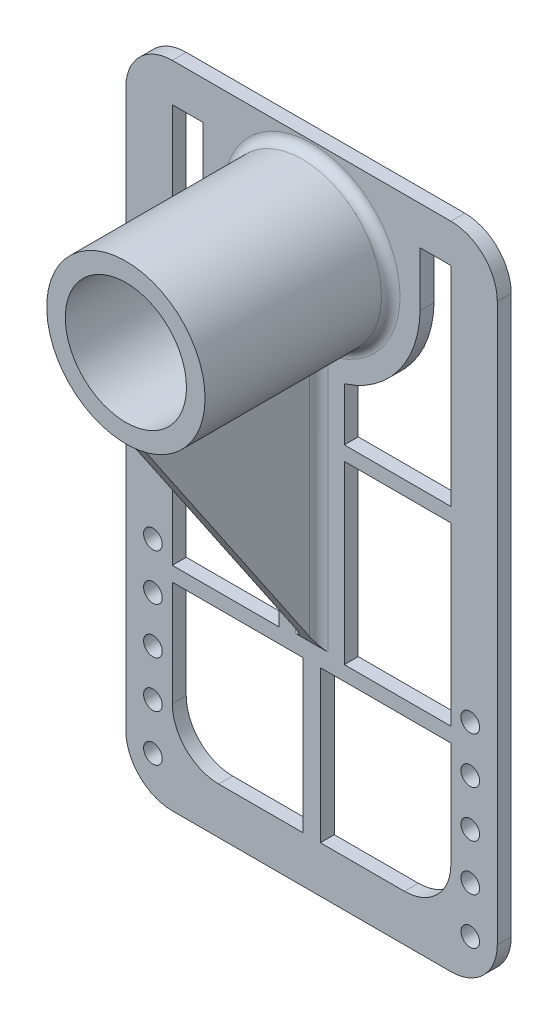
ISO-10303-21;
HEADER;
FILE_DESCRIPTION(('STEP AP214'),'2;1');
FILE_NAME('part.step','',(''),(''),'','','');
FILE_SCHEMA(('AUTOMOTIVE_DESIGN { 1 0 10303 214 1 1 1 1 }'));
ENDSEC;
DATA;
#1=APPLICATION_CONTEXT('core data for automotive mechanical design processes');
#2=APPLICATION_PROTOCOL_DEFINITION('international standard','automotive_design',2000,#1);
#3=PRODUCT_CONTEXT('',#1,'mechanical');
#4=PRODUCT('Part','Part','',(#3));
#5=PRODUCT_RELATED_PRODUCT_CATEGORY('part','',(#4));
#6=PRODUCT_DEFINITION_FORMATION('','',#4);
#7=PRODUCT_DEFINITION_CONTEXT('part definition',#1,'design');
#8=PRODUCT_DEFINITION('design','',#6,#7);
#9=PRODUCT_DEFINITION_SHAPE('','',#8);
#10=(LENGTH_UNIT() NAMED_UNIT(*) SI_UNIT(.MILLI.,.METRE.));
#11=(NAMED_UNIT(*) PLANE_ANGLE_UNIT() SI_UNIT($,.RADIAN.));
#12=(NAMED_UNIT(*) SI_UNIT($,.STERADIAN.) SOLID_ANGLE_UNIT());
#13=UNCERTAINTY_MEASURE_WITH_UNIT(LENGTH_MEASURE(1.E-05),#10,'distance_accuracy_value','');
#14=(GEOMETRIC_REPRESENTATION_CONTEXT(3) GLOBAL_UNCERTAINTY_ASSIGNED_CONTEXT((#13)) GLOBAL_UNIT_ASSIGNED_CONTEXT((#10,
#11,#12)) REPRESENTATION_CONTEXT('',''));
#15=CARTESIAN_POINT('',(0.,0.,0.));
#16=DIRECTION('',(0.,0.,1.));
#17=DIRECTION('',(1.,0.,0.));
#18=AXIS2_PLACEMENT_3D('',#15,#16,#17);
#19=CARTESIAN_POINT('',(0.,0.,3.));
#20=DIRECTION('',(0.,0.,-1.));
#21=DIRECTION('',(-1.,0.,0.));
#22=AXIS2_PLACEMENT_3D('',#19,#20,#21);
#23=PLANE('',#22);
#24=CARTESIAN_POINT('',(-34.1766000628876,-91.8497984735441,3.));
#25=DIRECTION('',(0.,0.,-1.));
#26=DIRECTION('',(-1.,0.,0.));
#27=AXIS2_PLACEMENT_3D('',#24,#25,#26);
#28=CIRCLE('',#27,2.0114385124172);
#29=CARTESIAN_POINT('',(-36.1880385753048,-91.8497984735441,3.));
#30=VERTEX_POINT('',#29);
#31=EDGE_CURVE('E363',#30,#30,#28,.T.);
#32=ORIENTED_EDGE('',*,*,#31,.T.);
#33=EDGE_LOOP('',(#32));
#34=FACE_BOUND('',#33,.T.);
#35=CARTESIAN_POINT('',(34.1766000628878,-81.8497984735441,3.));
#36=DIRECTION('',(0.,0.,-1.));
#37=DIRECTION('',(-1.,0.,0.));
#38=AXIS2_PLACEMENT_3D('',#35,#36,#37);
#39=CIRCLE('',#38,2.0114385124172);
#40=CARTESIAN_POINT('',(32.1651615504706,-81.8497984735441,3.));
#41=VERTEX_POINT('',#40);
#42=EDGE_CURVE('E1564',#41,#41,#39,.T.);
#43=ORIENTED_EDGE('',*,*,#42,.T.);
#44=EDGE_LOOP('',(#43));
#45=FACE_BOUND('',#44,.T.);
#46=CARTESIAN_POINT('',(-34.1766000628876,-81.8497984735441,3.));
#47=DIRECTION('',(0.,0.,-1.));
#48=DIRECTION('',(-1.,0.,0.));
#49=AXIS2_PLACEMENT_3D('',#46,#47,#48);
#50=CIRCLE('',#49,2.0114385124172);
#51=CARTESIAN_POINT('',(-36.1880385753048,-81.8497984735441,3.));
#52=VERTEX_POINT('',#51);
#53=EDGE_CURVE('E1567',#52,#52,#50,.T.);
#54=ORIENTED_EDGE('',*,*,#53,.T.);
#55=EDGE_LOOP('',(#54));
#56=FACE_BOUND('',#55,.T.);
#57=CARTESIAN_POINT('',(34.1766000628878,-71.8497984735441,3.));
#58=DIRECTION('',(0.,0.,-1.));
#59=DIRECTION('',(-1.,0.,0.));
#60=AXIS2_PLACEMENT_3D('',#57,#58,#59);
#61=CIRCLE('',#60,2.0114385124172);
#62=CARTESIAN_POINT('',(32.1651615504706,-71.8497984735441,3.));
#63=VERTEX_POINT('',#62);
#64=EDGE_CURVE('E1571',#63,#63,#61,.T.);
#65=ORIENTED_EDGE('',*,*,#64,.T.);
#66=EDGE_LOOP('',(#65));
#67=FACE_BOUND('',#66,.T.);
#68=CARTESIAN_POINT('',(-34.1766000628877,-111.849798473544,3.));
#69=DIRECTION('',(0.,0.,-1.));
#70=DIRECTION('',(-1.,0.,0.));
#71=AXIS2_PLACEMENT_3D('',#68,#69,#70);
#72=CIRCLE('',#71,2.0114385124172);
#73=CARTESIAN_POINT('',(-36.1880385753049,-111.849798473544,3.));
#74=VERTEX_POINT('',#73);
#75=EDGE_CURVE('E1577',#74,#74,#72,.T.);
#76=ORIENTED_EDGE('',*,*,#75,.T.);
#77=EDGE_LOOP('',(#76));
#78=FACE_BOUND('',#77,.T.);
#79=CARTESIAN_POINT('',(34.1766000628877,-101.849798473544,3.));
#80=DIRECTION('',(0.,0.,-1.));
#81=DIRECTION('',(-1.,0.,0.));
#82=AXIS2_PLACEMENT_3D('',#79,#80,#81);
#83=CIRCLE('',#82,2.0114385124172);
#84=CARTESIAN_POINT('',(32.1651615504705,-101.849798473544,3.));
#85=VERTEX_POINT('',#84);
#86=EDGE_CURVE('E1581',#85,#85,#83,.T.);
#87=ORIENTED_EDGE('',*,*,#86,.T.);
#88=EDGE_LOOP('',(#87));
#89=FACE_BOUND('',#88,.T.);
#90=CARTESIAN_POINT('',(-34.1766000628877,-101.849798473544,3.));
#91=DIRECTION('',(0.,0.,-1.));
#92=DIRECTION('',(-1.,0.,0.));
#93=AXIS2_PLACEMENT_3D('',#90,#91,#92);
#94=CIRCLE('',#93,2.0114385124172);
#95=CARTESIAN_POINT('',(-36.1880385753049,-101.849798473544,3.));
#96=VERTEX_POINT('',#95);
#97=EDGE_CURVE('E1585',#96,#96,#94,.T.);
#98=ORIENTED_EDGE('',*,*,#97,.T.);
#99=EDGE_LOOP('',(#98));
#100=FACE_BOUND('',#99,.T.);
#101=CARTESIAN_POINT('',(34.1766000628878,-91.8497984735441,3.));
#102=DIRECTION('',(0.,0.,-1.));
#103=DIRECTION('',(-1.,0.,0.));
#104=AXIS2_PLACEMENT_3D('',#101,#102,#103);
#105=CIRCLE('',#104,2.0114385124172);
#106=CARTESIAN_POINT('',(32.1651615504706,-91.8497984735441,3.));
#107=VERTEX_POINT('',#106);
#108=EDGE_CURVE('E1589',#107,#107,#105,.T.);
#109=ORIENTED_EDGE('',*,*,#108,.T.);
#110=EDGE_LOOP('',(#109));
#111=FACE_BOUND('',#110,.T.);
#112=CARTESIAN_POINT('',(-34.1766000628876,-71.8497984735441,3.));
#113=DIRECTION('',(0.,0.,-1.));
#114=DIRECTION('',(-1.,0.,0.));
#115=AXIS2_PLACEMENT_3D('',#112,#113,#114);
#116=CIRCLE('',#115,2.0114385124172);
#117=CARTESIAN_POINT('',(-36.1880385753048,-71.8497984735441,3.));
#118=VERTEX_POINT('',#117);
#119=EDGE_CURVE('E1593',#118,#118,#116,.T.);
#120=ORIENTED_EDGE('',*,*,#119,.T.);
#121=EDGE_LOOP('',(#120));
#122=FACE_BOUND('',#121,.T.);
#123=CARTESIAN_POINT('',(34.1766000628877,-111.849798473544,3.));
#124=DIRECTION('',(0.,0.,-1.));
#125=DIRECTION('',(-1.,0.,0.));
#126=AXIS2_PLACEMENT_3D('',#123,#124,#125);
#127=CIRCLE('',#126,2.0114385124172);
#128=CARTESIAN_POINT('',(32.1651615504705,-111.849798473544,3.));
#129=VERTEX_POINT('',#128);
#130=EDGE_CURVE('E1597',#129,#129,#127,.T.);
#131=ORIENTED_EDGE('',*,*,#130,.T.);
#132=EDGE_LOOP('',(#131));
#133=FACE_BOUND('',#132,.T.);
#134=DIRECTION('',(-1.,0.,0.));
#135=VECTOR('',#134,1.);
#136=CARTESIAN_POINT('',(-30.,-36.7772149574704,3.));
#137=LINE('',#136,#135);
#138=CARTESIAN_POINT('',(-7.05217697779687,-36.7772149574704,3.));
#139=VERTEX_POINT('',#138);
#140=CARTESIAN_POINT('',(-30.,-36.7772149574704,3.));
#141=VERTEX_POINT('',#140);
#142=EDGE_CURVE('E472',#139,#141,#137,.T.);
#143=ORIENTED_EDGE('',*,*,#142,.F.);
#144=DIRECTION('',(0.,1.,0.));
#145=VECTOR('',#144,1.);
#146=CARTESIAN_POINT('',(-7.05217697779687,-36.7772149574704,3.));
#147=LINE('',#146,#145);
#148=CARTESIAN_POINT('',(-7.05217697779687,-74.6954367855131,3.));
#149=VERTEX_POINT('',#148);
#150=EDGE_CURVE('E57',#149,#139,#147,.T.);
#151=ORIENTED_EDGE('',*,*,#150,.F.);
#152=DIRECTION('',(1.,0.,0.));
#153=VECTOR('',#152,1.);
#154=CARTESIAN_POINT('',(-7.05217697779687,-74.6954367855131,3.));
#155=LINE('',#154,#153);
#156=CARTESIAN_POINT('',(-30.,-74.6954367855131,3.));
#157=VERTEX_POINT('',#156);
#158=EDGE_CURVE('E457',#157,#149,#155,.T.);
#159=ORIENTED_EDGE('',*,*,#158,.F.);
#160=DIRECTION('',(0.,-1.,0.));
#161=VECTOR('',#160,1.);
#162=CARTESIAN_POINT('',(-30.,-36.7772149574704,3.));
#163=LINE('',#162,#161);
#164=EDGE_CURVE('E476',#141,#157,#163,.T.);
#165=ORIENTED_EDGE('',*,*,#164,.F.);
#166=EDGE_LOOP('',(#143,#151,#159,#165));
#167=FACE_BOUND('',#166,.T.);
#168=DIRECTION('',(0.,-1.,0.));
#169=VECTOR('',#168,1.);
#170=CARTESIAN_POINT('',(7.05217697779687,-22.2953164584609,3.));
#171=LINE('',#170,#169);
#172=CARTESIAN_POINT('',(7.05217697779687,-22.2953164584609,3.));
#173=VERTEX_POINT('',#172);
#174=CARTESIAN_POINT('',(7.05217697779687,-33.7076446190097,3.));
#175=VERTEX_POINT('',#174);
#176=EDGE_CURVE('E414',#173,#175,#171,.T.);
#177=ORIENTED_EDGE('',*,*,#176,.F.);
#178=CARTESIAN_POINT('',(0.,0.,3.));
#179=DIRECTION('',(0.,0.,-1.));
#180=DIRECTION('',(1.,0.,0.));
#181=AXIS2_PLACEMENT_3D('',#178,#179,#180);
#182=CIRCLE('',#181,23.3840615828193);
#183=CARTESIAN_POINT('',(23.3787154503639,-0.500000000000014,3.));
#184=VERTEX_POINT('',#183);
#185=EDGE_CURVE('E65',#184,#173,#182,.T.);
#186=ORIENTED_EDGE('',*,*,#185,.F.);
#187=DIRECTION('',(0.,-1.,0.));
#188=VECTOR('',#187,1.);
#189=CARTESIAN_POINT('',(23.3787154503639,-0.500000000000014,3.));
#190=LINE('',#189,#188);
#191=CARTESIAN_POINT('',(23.3787154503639,11.2341673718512,3.));
#192=VERTEX_POINT('',#191);
#193=EDGE_CURVE('E391',#192,#184,#190,.T.);
#194=ORIENTED_EDGE('',*,*,#193,.F.);
#195=DIRECTION('',(-1.,0.,0.));
#196=VECTOR('',#195,1.);
#197=CARTESIAN_POINT('',(23.3787154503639,11.2341673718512,3.));
#198=LINE('',#197,#196);
#199=CARTESIAN_POINT('',(30.,11.2341673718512,3.));
#200=VERTEX_POINT('',#199);
#201=EDGE_CURVE('E427',#200,#192,#198,.T.);
#202=ORIENTED_EDGE('',*,*,#201,.F.);
#203=DIRECTION('',(0.,1.,0.));
#204=VECTOR('',#203,1.);
#205=CARTESIAN_POINT('',(30.,-0.500000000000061,3.));
#206=LINE('',#205,#204);
#207=CARTESIAN_POINT('',(30.,-33.7076446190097,3.));
#208=VERTEX_POINT('',#207);
#209=EDGE_CURVE('E423',#208,#200,#206,.T.);
#210=ORIENTED_EDGE('',*,*,#209,.F.);
#211=DIRECTION('',(1.,0.,0.));
#212=VECTOR('',#211,1.);
#213=CARTESIAN_POINT('',(30.,-33.7076446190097,3.));
#214=LINE('',#213,#212);
#215=EDGE_CURVE('E419',#175,#208,#214,.T.);
#216=ORIENTED_EDGE('',*,*,#215,.F.);
#217=EDGE_LOOP('',(#177,#186,#194,#202,#210,#216));
#218=FACE_BOUND('',#217,.T.);
#219=DIRECTION('',(0.,-1.,0.));
#220=VECTOR('',#219,1.);
#221=CARTESIAN_POINT('',(-30.,-0.500000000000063,3.));
#222=LINE('',#221,#220);
#223=CARTESIAN_POINT('',(-30.,11.2341673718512,3.));
#224=VERTEX_POINT('',#223);
#225=CARTESIAN_POINT('',(-30.,-33.7076446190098,3.));
#226=VERTEX_POINT('',#225);
#227=EDGE_CURVE('E437',#224,#226,#222,.T.);
#228=ORIENTED_EDGE('',*,*,#227,.F.);
#229=DIRECTION('',(-1.,0.,0.));
#230=VECTOR('',#229,1.);
#231=CARTESIAN_POINT('',(-30.,11.2341673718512,3.));
#232=LINE('',#231,#230);
#233=CARTESIAN_POINT('',(-23.3787154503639,11.2341673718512,3.));
#234=VERTEX_POINT('',#233);
#235=EDGE_CURVE('E555',#234,#224,#232,.T.);
#236=ORIENTED_EDGE('',*,*,#235,.F.);
#237=DIRECTION('',(0.,1.,0.));
#238=VECTOR('',#237,1.);
#239=CARTESIAN_POINT('',(-23.3787154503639,-0.500000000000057,3.));
#240=LINE('',#239,#238);
#241=CARTESIAN_POINT('',(-23.3787154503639,-0.500000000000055,3.));
#242=VERTEX_POINT('',#241);
#243=EDGE_CURVE('E591',#242,#234,#240,.T.);
#244=ORIENTED_EDGE('',*,*,#243,.F.);
#245=CARTESIAN_POINT('',(0.,0.,3.));
#246=DIRECTION('',(0.,0.,-1.));
#247=DIRECTION('',(1.,0.,0.));
#248=AXIS2_PLACEMENT_3D('',#245,#246,#247);
#249=CIRCLE('',#248,23.3840615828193);
#250=CARTESIAN_POINT('',(-7.05217697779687,-22.2953164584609,3.));
#251=VERTEX_POINT('',#250);
#252=EDGE_CURVE('E587',#251,#242,#249,.T.);
#253=ORIENTED_EDGE('',*,*,#252,.F.);
#254=DIRECTION('',(0.,1.,0.));
#255=VECTOR('',#254,1.);
#256=CARTESIAN_POINT('',(-7.05217697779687,-22.2953164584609,3.));
#257=LINE('',#256,#255);
#258=CARTESIAN_POINT('',(-7.05217697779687,-33.7076446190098,3.));
#259=VERTEX_POINT('',#258);
#260=EDGE_CURVE('E583',#259,#251,#257,.T.);
#261=ORIENTED_EDGE('',*,*,#260,.F.);
#262=DIRECTION('',(1.,0.,0.));
#263=VECTOR('',#262,1.);
#264=CARTESIAN_POINT('',(-30.,-33.7076446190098,3.));
#265=LINE('',#264,#263);
#266=EDGE_CURVE('E579',#226,#259,#265,.T.);
#267=ORIENTED_EDGE('',*,*,#266,.F.);
#268=EDGE_LOOP('',(#228,#236,#244,#253,#261,#267));
#269=FACE_BOUND('',#268,.T.);
#270=DIRECTION('',(1.,0.,0.));
#271=VECTOR('',#270,1.);
#272=CARTESIAN_POINT('',(-19.9999999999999,-110.5,3.));
#273=LINE('',#272,#271);
#274=CARTESIAN_POINT('',(-19.9999999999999,-110.5,3.));
#275=VERTEX_POINT('',#274);
#276=CARTESIAN_POINT('',(-1.89591109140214,-110.5,3.));
#277=VERTEX_POINT('',#276);
#278=EDGE_CURVE('E518',#275,#277,#273,.T.);
#279=ORIENTED_EDGE('',*,*,#278,.F.);
#280=CARTESIAN_POINT('',(-20.,-100.5,3.));
#281=DIRECTION('',(0.,0.,1.));
#282=DIRECTION('',(-1.,0.,0.));
#283=AXIS2_PLACEMENT_3D('',#280,#281,#282);
#284=CIRCLE('',#283,10.);
#285=CARTESIAN_POINT('',(-30.,-100.5,3.));
#286=VERTEX_POINT('',#285);
#287=EDGE_CURVE('E515',#286,#275,#284,.T.);
#288=ORIENTED_EDGE('',*,*,#287,.F.);
#289=DIRECTION('',(0.,-1.,0.));
#290=VECTOR('',#289,1.);
#291=CARTESIAN_POINT('',(-30.,-77.841471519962,3.));
#292=LINE('',#291,#290);
#293=CARTESIAN_POINT('',(-30.,-77.841471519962,3.));
#294=VERTEX_POINT('',#293);
#295=EDGE_CURVE('E498',#294,#286,#292,.T.);
#296=ORIENTED_EDGE('',*,*,#295,.F.);
#297=DIRECTION('',(-1.,0.,0.));
#298=VECTOR('',#297,1.);
#299=CARTESIAN_POINT('',(-7.05217697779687,-77.841471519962,3.));
#300=LINE('',#299,#298);
#301=CARTESIAN_POINT('',(-1.89591109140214,-77.841471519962,3.));
#302=VERTEX_POINT('',#301);
#303=EDGE_CURVE('E527',#302,#294,#300,.T.);
#304=ORIENTED_EDGE('',*,*,#303,.F.);
#305=DIRECTION('',(0.,1.,0.));
#306=VECTOR('',#305,1.);
#307=CARTESIAN_POINT('',(-1.89591109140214,-77.841471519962,3.));
#308=LINE('',#307,#306);
#309=EDGE_CURVE('E523',#277,#302,#308,.T.);
#310=ORIENTED_EDGE('',*,*,#309,.F.);
#311=EDGE_LOOP('',(#279,#288,#296,#304,#310));
#312=FACE_BOUND('',#311,.T.);
#313=DIRECTION('',(-1.,0.,0.));
#314=VECTOR('',#313,1.);
#315=CARTESIAN_POINT('',(30.,-36.7772149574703,3.));
#316=LINE('',#315,#314);
#317=CARTESIAN_POINT('',(30.,-36.7772149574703,3.));
#318=VERTEX_POINT('',#317);
#319=CARTESIAN_POINT('',(7.05217697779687,-36.7772149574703,3.));
#320=VERTEX_POINT('',#319);
#321=EDGE_CURVE('E372',#318,#320,#316,.T.);
#322=ORIENTED_EDGE('',*,*,#321,.F.);
#323=DIRECTION('',(0.,1.,0.));
#324=VECTOR('',#323,1.);
#325=CARTESIAN_POINT('',(30.,-74.695436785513,3.));
#326=LINE('',#325,#324);
#327=CARTESIAN_POINT('',(30.,-74.695436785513,3.));
#328=VERTEX_POINT('',#327);
#329=EDGE_CURVE('E335',#328,#318,#326,.T.);
#330=ORIENTED_EDGE('',*,*,#329,.F.);
#331=DIRECTION('',(1.,0.,0.));
#332=VECTOR('',#331,1.);
#333=CARTESIAN_POINT('',(7.05217697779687,-74.695436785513,3.));
#334=LINE('',#333,#332);
#335=CARTESIAN_POINT('',(7.05217697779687,-74.695436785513,3.));
#336=VERTEX_POINT('',#335);
#337=EDGE_CURVE('E356',#336,#328,#334,.T.);
#338=ORIENTED_EDGE('',*,*,#337,.F.);
#339=DIRECTION('',(0.,-1.,0.));
#340=VECTOR('',#339,1.);
#341=CARTESIAN_POINT('',(7.05217697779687,-36.7772149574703,3.));
#342=LINE('',#341,#340);
#343=EDGE_CURVE('E360',#320,#336,#342,.T.);
#344=ORIENTED_EDGE('',*,*,#343,.F.);
#345=EDGE_LOOP('',(#322,#330,#338,#344));
#346=FACE_BOUND('',#345,.T.);
#347=DIRECTION('',(0.,1.,0.));
#348=VECTOR('',#347,1.);
#349=CARTESIAN_POINT('',(30.,-100.5,3.));
#350=LINE('',#349,#348);
#351=CARTESIAN_POINT('',(30.,-100.5,3.));
#352=VERTEX_POINT('',#351);
#353=CARTESIAN_POINT('',(30.,-77.841471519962,3.));
#354=VERTEX_POINT('',#353);
#355=EDGE_CURVE('E638',#352,#354,#350,.T.);
#356=ORIENTED_EDGE('',*,*,#355,.F.);
#357=CARTESIAN_POINT('',(20.,-100.5,3.));
#358=DIRECTION('',(0.,0.,1.));
#359=DIRECTION('',(-1.,0.,0.));
#360=AXIS2_PLACEMENT_3D('',#357,#358,#359);
#361=CIRCLE('',#360,10.);
#362=CARTESIAN_POINT('',(19.9999999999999,-110.5,3.));
#363=VERTEX_POINT('',#362);
#364=EDGE_CURVE('E537',#363,#352,#361,.T.);
#365=ORIENTED_EDGE('',*,*,#364,.F.);
#366=DIRECTION('',(1.,0.,0.));
#367=VECTOR('',#366,1.);
#368=CARTESIAN_POINT('',(1.89591109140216,-110.5,3.));
#369=LINE('',#368,#367);
#370=CARTESIAN_POINT('',(1.89591109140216,-110.5,3.));
#371=VERTEX_POINT('',#370);
#372=EDGE_CURVE('E619',#371,#363,#369,.T.);
#373=ORIENTED_EDGE('',*,*,#372,.F.);
#374=DIRECTION('',(0.,-1.,0.));
#375=VECTOR('',#374,1.);
#376=CARTESIAN_POINT('',(1.89591109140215,-77.841471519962,3.));
#377=LINE('',#376,#375);
#378=CARTESIAN_POINT('',(1.89591109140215,-77.841471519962,3.));
#379=VERTEX_POINT('',#378);
#380=EDGE_CURVE('E646',#379,#371,#377,.T.);
#381=ORIENTED_EDGE('',*,*,#380,.F.);
#382=DIRECTION('',(-1.,0.,0.));
#383=VECTOR('',#382,1.);
#384=CARTESIAN_POINT('',(1.89591109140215,-77.841471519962,3.));
#385=LINE('',#384,#383);
#386=EDGE_CURVE('E642',#354,#379,#385,.T.);
#387=ORIENTED_EDGE('',*,*,#386,.F.);
#388=EDGE_LOOP('',(#356,#365,#373,#381,#387));
#389=FACE_BOUND('',#388,.T.);
#390=DIRECTION('',(1.,0.,0.));
#391=VECTOR('',#390,1.);
#392=CARTESIAN_POINT('',(40.,-120.5,3.));
#393=LINE('',#392,#391);
#394=CARTESIAN_POINT('',(-30.,-120.5,3.));
#395=VERTEX_POINT('',#394);
#396=CARTESIAN_POINT('',(30.,-120.5,3.));
#397=VERTEX_POINT('',#396);
#398=EDGE_CURVE('E711',#395,#397,#393,.T.);
#399=ORIENTED_EDGE('',*,*,#398,.T.);
#400=CARTESIAN_POINT('',(30.,-110.5,3.));
#401=DIRECTION('',(0.,0.,-1.));
#402=DIRECTION('',(-1.,0.,0.));
#403=AXIS2_PLACEMENT_3D('',#400,#401,#402);
#404=CIRCLE('',#403,10.);
#405=CARTESIAN_POINT('',(40.,-110.5,3.));
#406=VERTEX_POINT('',#405);
#407=EDGE_CURVE('E840',#397,#406,#404,.F.);
#408=ORIENTED_EDGE('',*,*,#407,.T.);
#409=DIRECTION('',(0.,1.,0.));
#410=VECTOR('',#409,1.);
#411=CARTESIAN_POINT('',(40.,19.5,3.));
#412=LINE('',#411,#410);
#413=CARTESIAN_POINT('',(40.,9.50000000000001,3.));
#414=VERTEX_POINT('',#413);
#415=EDGE_CURVE('E698',#406,#414,#412,.T.);
#416=ORIENTED_EDGE('',*,*,#415,.T.);
#417=CARTESIAN_POINT('',(30.,9.50000000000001,3.));
#418=DIRECTION('',(0.,0.,-1.));
#419=DIRECTION('',(-1.,0.,0.));
#420=AXIS2_PLACEMENT_3D('',#417,#418,#419);
#421=CIRCLE('',#420,10.);
#422=CARTESIAN_POINT('',(30.,19.5,3.));
#423=VERTEX_POINT('',#422);
#424=EDGE_CURVE('E831',#414,#423,#421,.F.);
#425=ORIENTED_EDGE('',*,*,#424,.T.);
#426=DIRECTION('',(-1.,0.,0.));
#427=VECTOR('',#426,1.);
#428=CARTESIAN_POINT('',(40.,19.5,3.));
#429=LINE('',#428,#427);
#430=CARTESIAN_POINT('',(-30.,19.5,3.));
#431=VERTEX_POINT('',#430);
#432=EDGE_CURVE('E702',#423,#431,#429,.T.);
#433=ORIENTED_EDGE('',*,*,#432,.T.);
#434=CARTESIAN_POINT('',(-30.,9.5,3.));
#435=DIRECTION('',(0.,0.,-1.));
#436=DIRECTION('',(-1.,0.,0.));
#437=AXIS2_PLACEMENT_3D('',#434,#435,#436);
#438=CIRCLE('',#437,10.);
#439=CARTESIAN_POINT('',(-40.,9.5,3.));
#440=VERTEX_POINT('',#439);
#441=EDGE_CURVE('E834',#431,#440,#438,.F.);
#442=ORIENTED_EDGE('',*,*,#441,.T.);
#443=DIRECTION('',(0.,-1.,0.));
#444=VECTOR('',#443,1.);
#445=CARTESIAN_POINT('',(-40.,19.5,3.));
#446=LINE('',#445,#444);
#447=CARTESIAN_POINT('',(-40.,-110.5,3.));
#448=VERTEX_POINT('',#447);
#449=EDGE_CURVE('E707',#440,#448,#446,.T.);
#450=ORIENTED_EDGE('',*,*,#449,.T.);
#451=CARTESIAN_POINT('',(-30.,-110.5,3.));
#452=DIRECTION('',(0.,0.,-1.));
#453=DIRECTION('',(-1.,0.,0.));
#454=AXIS2_PLACEMENT_3D('',#451,#452,#453);
#455=CIRCLE('',#454,10.);
#456=EDGE_CURVE('E837',#448,#395,#455,.F.);
#457=ORIENTED_EDGE('',*,*,#456,.T.);
#458=EDGE_LOOP('',(#399,#408,#416,#425,#433,#442,#450,#457));
#459=FACE_BOUND('',#458,.T.);
#460=DIRECTION('',(-1.,0.,0.));
#461=VECTOR('',#460,1.);
#462=CARTESIAN_POINT('',(1.5,-74.1245637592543,3.));
#463=LINE('',#462,#461);
#464=CARTESIAN_POINT('',(3.5,-74.1245637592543,3.));
#465=VERTEX_POINT('',#464);
#466=CARTESIAN_POINT('',(-3.5,-74.1245637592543,3.));
#467=VERTEX_POINT('',#466);
#468=EDGE_CURVE('E677',#465,#467,#463,.T.);
#469=ORIENTED_EDGE('',*,*,#468,.T.);
#470=DIRECTION('',(0.,1.,0.));
#471=VECTOR('',#470,1.);
#472=CARTESIAN_POINT('',(-3.5,0.,3.));
#473=LINE('',#472,#471);
#474=CARTESIAN_POINT('',(-3.5,-18.7257176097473,3.));
#475=VERTEX_POINT('',#474);
#476=EDGE_CURVE('E770',#467,#475,#473,.T.);
#477=ORIENTED_EDGE('',*,*,#476,.T.);
#478=CARTESIAN_POINT('',(0.,0.,3.));
#479=DIRECTION('',(0.,0.,-1.));
#480=DIRECTION('',(-1.,0.,0.));
#481=AXIS2_PLACEMENT_3D('',#478,#479,#480);
#482=CIRCLE('',#481,19.05);
#483=CARTESIAN_POINT('',(3.5,-18.7257176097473,3.));
#484=VERTEX_POINT('',#483);
#485=EDGE_CURVE('E733',#475,#484,#482,.T.);
#486=ORIENTED_EDGE('',*,*,#485,.T.);
#487=DIRECTION('',(0.,1.,0.));
#488=VECTOR('',#487,1.);
#489=CARTESIAN_POINT('',(3.5,-74.1245637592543,3.));
#490=LINE('',#489,#488);
#491=EDGE_CURVE('E766',#484,#465,#490,.F.);
#492=ORIENTED_EDGE('',*,*,#491,.T.);
#493=EDGE_LOOP('',(#469,#477,#486,#492));
#494=FACE_BOUND('',#493,.T.);
#495=ADVANCED_FACE('F41',(#34,#45,#56,#67,#78,#89,#100,#111,#122,#133,#167,#218,#269,#312,#346,
#389,#459,#494),#23,.F.);
#496=CARTESIAN_POINT('',(0.,0.,43.));
#497=DIRECTION('',(0.,0.,-1.));
#498=DIRECTION('',(-1.,0.,0.));
#499=AXIS2_PLACEMENT_3D('',#496,#497,#498);
#500=CYLINDRICAL_SURFACE('',#499,17.05);
#501=CARTESIAN_POINT('',(0.,0.,43.));
#502=DIRECTION('',(0.,0.,1.));
#503=DIRECTION('',(1.,0.,0.));
#504=AXIS2_PLACEMENT_3D('',#501,#502,#503);
#505=CIRCLE('',#504,17.05);
#506=CARTESIAN_POINT('',(17.05,0.,43.));
#507=VERTEX_POINT('',#506);
#508=EDGE_CURVE('E689',#507,#507,#505,.T.);
#509=ORIENTED_EDGE('',*,*,#508,.F.);
#510=EDGE_LOOP('',(#509));
#511=FACE_BOUND('',#510,.T.);
#512=CARTESIAN_POINT('',(0.,0.,5.));
#513=DIRECTION('',(0.,0.,-1.));
#514=DIRECTION('',(-1.,0.,0.));
#515=AXIS2_PLACEMENT_3D('',#512,#513,#514);
#516=CIRCLE('',#515,17.05);
#517=CARTESIAN_POINT('',(3.13254593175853,-16.7597630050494,5.));
#518=VERTEX_POINT('',#517);
#519=CARTESIAN_POINT('',(-3.13254593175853,-16.7597630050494,5.));
#520=VERTEX_POINT('',#519);
#521=EDGE_CURVE('E715',#518,#520,#516,.F.);
#522=ORIENTED_EDGE('',*,*,#521,.T.);
#523=DIRECTION('',(0.,0.,-1.));
#524=VECTOR('',#523,1.);
#525=CARTESIAN_POINT('',(-3.13254593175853,-16.7597630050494,43.));
#526=LINE('',#525,#524);
#527=CARTESIAN_POINT('',(-3.13254593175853,-16.7597630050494,41.9103579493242));
#528=VERTEX_POINT('',#527);
#529=EDGE_CURVE('E743',#520,#528,#526,.F.);
#530=ORIENTED_EDGE('',*,*,#529,.T.);
#531=CARTESIAN_POINT('',(0.,0.,53.2784507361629));
#532=DIRECTION('',(0.,0.561345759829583,-0.827581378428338));
#533=DIRECTION('',(0.,-0.827581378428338,-0.561345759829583));
#534=AXIS2_PLACEMENT_3D('',#531,#532,#533);
#535=ELLIPSE('',#534,20.6022035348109,17.05);
#536=CARTESIAN_POINT('',(3.13254593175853,-16.7597630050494,41.9103579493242));
#537=VERTEX_POINT('',#536);
#538=EDGE_CURVE('E737',#537,#528,#535,.T.);
#539=ORIENTED_EDGE('',*,*,#538,.F.);
#540=DIRECTION('',(0.,0.,-1.));
#541=VECTOR('',#540,1.);
#542=CARTESIAN_POINT('',(3.13254593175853,-16.7597630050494,43.));
#543=LINE('',#542,#541);
#544=EDGE_CURVE('E740',#537,#518,#543,.T.);
#545=ORIENTED_EDGE('',*,*,#544,.T.);
#546=EDGE_LOOP('',(#522,#530,#539,#545));
#547=FACE_BOUND('',#546,.T.);
#548=ADVANCED_FACE('F900',(#511,#547),#500,.T.);
#549=CARTESIAN_POINT('',(0.,0.,5.));
#550=DIRECTION('',(0.,0.,-1.));
#551=DIRECTION('',(-1.,0.,0.));
#552=AXIS2_PLACEMENT_3D('',#549,#550,#551);
#553=TOROIDAL_SURFACE('',#552,19.05,2.);
#554=ORIENTED_EDGE('',*,*,#485,.F.);
#555=CARTESIAN_POINT('',(-3.5,-18.7257176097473,5.));
#556=DIRECTION('',(-0.982977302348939,0.183727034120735,0.));
#557=DIRECTION('',(-0.183727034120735,-0.982977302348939,0.));
#558=AXIS2_PLACEMENT_3D('',#555,#556,#557);
#559=CIRCLE('',#558,2.);
#560=EDGE_CURVE('E756',#475,#520,#559,.F.);
#561=ORIENTED_EDGE('',*,*,#560,.T.);
#562=ORIENTED_EDGE('',*,*,#521,.F.);
#563=CARTESIAN_POINT('',(3.5,-18.7257176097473,5.));
#564=DIRECTION('',(-0.982977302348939,-0.183727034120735,0.));
#565=DIRECTION('',(0.183727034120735,-0.982977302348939,0.));
#566=AXIS2_PLACEMENT_3D('',#563,#564,#565);
#567=CIRCLE('',#566,2.);
#568=EDGE_CURVE('E753',#518,#484,#567,.T.);
#569=ORIENTED_EDGE('',*,*,#568,.T.);
#570=EDGE_LOOP('',(#554,#561,#562,#569));
#571=FACE_BOUND('',#570,.T.);
#572=ADVANCED_FACE('F908',(#571),#553,.F.);
#573=CARTESIAN_POINT('',(0.,0.,0.));
#574=DIRECTION('',(0.,0.,-1.));
#575=DIRECTION('',(-1.,0.,0.));
#576=AXIS2_PLACEMENT_3D('',#573,#574,#575);
#577=PLANE('',#576);
#578=CARTESIAN_POINT('',(-34.1766000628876,-91.8497984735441,0.));
#579=DIRECTION('',(0.,0.,-1.));
#580=DIRECTION('',(1.,0.,0.));
#581=AXIS2_PLACEMENT_3D('',#578,#579,#580);
#582=CIRCLE('',#581,2.0114385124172);
#583=CARTESIAN_POINT('',(-32.1651615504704,-91.8497984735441,0.));
#584=VERTEX_POINT('',#583);
#585=EDGE_CURVE('E1561',#584,#584,#582,.T.);
#586=ORIENTED_EDGE('',*,*,#585,.F.);
#587=EDGE_LOOP('',(#586));
#588=FACE_BOUND('',#587,.T.);
#589=CARTESIAN_POINT('',(34.1766000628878,-81.8497984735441,0.));
#590=DIRECTION('',(0.,0.,-1.));
#591=DIRECTION('',(-1.,0.,0.));
#592=AXIS2_PLACEMENT_3D('',#589,#590,#591);
#593=CIRCLE('',#592,2.0114385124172);
#594=CARTESIAN_POINT('',(32.1651615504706,-81.8497984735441,0.));
#595=VERTEX_POINT('',#594);
#596=EDGE_CURVE('E1621',#595,#595,#593,.T.);
#597=ORIENTED_EDGE('',*,*,#596,.F.);
#598=EDGE_LOOP('',(#597));
#599=FACE_BOUND('',#598,.T.);
#600=CARTESIAN_POINT('',(-34.1766000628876,-81.8497984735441,0.));
#601=DIRECTION('',(0.,0.,-1.));
#602=DIRECTION('',(1.,0.,0.));
#603=AXIS2_PLACEMENT_3D('',#600,#601,#602);
#604=CIRCLE('',#603,2.0114385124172);
#605=CARTESIAN_POINT('',(-32.1651615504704,-81.8497984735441,0.));
#606=VERTEX_POINT('',#605);
#607=EDGE_CURVE('E1625',#606,#606,#604,.T.);
#608=ORIENTED_EDGE('',*,*,#607,.F.);
#609=EDGE_LOOP('',(#608));
#610=FACE_BOUND('',#609,.T.);
#611=CARTESIAN_POINT('',(34.1766000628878,-71.8497984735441,0.));
#612=DIRECTION('',(0.,0.,-1.));
#613=DIRECTION('',(-1.,0.,0.));
#614=AXIS2_PLACEMENT_3D('',#611,#612,#613);
#615=CIRCLE('',#614,2.0114385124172);
#616=CARTESIAN_POINT('',(32.1651615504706,-71.8497984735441,0.));
#617=VERTEX_POINT('',#616);
#618=EDGE_CURVE('E1628',#617,#617,#615,.T.);
#619=ORIENTED_EDGE('',*,*,#618,.F.);
#620=EDGE_LOOP('',(#619));
#621=FACE_BOUND('',#620,.T.);
#622=CARTESIAN_POINT('',(-34.1766000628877,-111.849798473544,0.));
#623=DIRECTION('',(0.,0.,-1.));
#624=DIRECTION('',(1.,0.,0.));
#625=AXIS2_PLACEMENT_3D('',#622,#623,#624);
#626=CIRCLE('',#625,2.0114385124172);
#627=CARTESIAN_POINT('',(-32.1651615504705,-111.849798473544,0.));
#628=VERTEX_POINT('',#627);
#629=EDGE_CURVE('E1605',#628,#628,#626,.T.);
#630=ORIENTED_EDGE('',*,*,#629,.F.);
#631=EDGE_LOOP('',(#630));
#632=FACE_BOUND('',#631,.T.);
#633=CARTESIAN_POINT('',(34.1766000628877,-101.849798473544,0.));
#634=DIRECTION('',(0.,0.,-1.));
#635=DIRECTION('',(-1.,0.,0.));
#636=AXIS2_PLACEMENT_3D('',#633,#634,#635);
#637=CIRCLE('',#636,2.0114385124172);
#638=CARTESIAN_POINT('',(32.1651615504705,-101.849798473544,0.));
#639=VERTEX_POINT('',#638);
#640=EDGE_CURVE('E1606',#639,#639,#637,.T.);
#641=ORIENTED_EDGE('',*,*,#640,.F.);
#642=EDGE_LOOP('',(#641));
#643=FACE_BOUND('',#642,.T.);
#644=CARTESIAN_POINT('',(-34.1766000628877,-101.849798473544,0.));
#645=DIRECTION('',(0.,0.,-1.));
#646=DIRECTION('',(1.,0.,0.));
#647=AXIS2_PLACEMENT_3D('',#644,#645,#646);
#648=CIRCLE('',#647,2.0114385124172);
#649=CARTESIAN_POINT('',(-32.1651615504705,-101.849798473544,0.));
#650=VERTEX_POINT('',#649);
#651=EDGE_CURVE('E1610',#650,#650,#648,.T.);
#652=ORIENTED_EDGE('',*,*,#651,.F.);
#653=EDGE_LOOP('',(#652));
#654=FACE_BOUND('',#653,.T.);
#655=CARTESIAN_POINT('',(34.1766000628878,-91.8497984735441,0.));
#656=DIRECTION('',(0.,0.,-1.));
#657=DIRECTION('',(-1.,0.,0.));
#658=AXIS2_PLACEMENT_3D('',#655,#656,#657);
#659=CIRCLE('',#658,2.0114385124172);
#660=CARTESIAN_POINT('',(32.1651615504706,-91.8497984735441,0.));
#661=VERTEX_POINT('',#660);
#662=EDGE_CURVE('E1614',#661,#661,#659,.T.);
#663=ORIENTED_EDGE('',*,*,#662,.F.);
#664=EDGE_LOOP('',(#663));
#665=FACE_BOUND('',#664,.T.);
#666=CARTESIAN_POINT('',(-34.1766000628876,-71.8497984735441,0.));
#667=DIRECTION('',(0.,0.,-1.));
#668=DIRECTION('',(1.,0.,0.));
#669=AXIS2_PLACEMENT_3D('',#666,#667,#668);
#670=CIRCLE('',#669,2.0114385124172);
#671=CARTESIAN_POINT('',(-32.1651615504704,-71.8497984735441,0.));
#672=VERTEX_POINT('',#671);
#673=EDGE_CURVE('E1632',#672,#672,#670,.T.);
#674=ORIENTED_EDGE('',*,*,#673,.F.);
#675=EDGE_LOOP('',(#674));
#676=FACE_BOUND('',#675,.T.);
#677=CARTESIAN_POINT('',(34.1766000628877,-111.849798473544,0.));
#678=DIRECTION('',(0.,0.,-1.));
#679=DIRECTION('',(-1.,0.,0.));
#680=AXIS2_PLACEMENT_3D('',#677,#678,#679);
#681=CIRCLE('',#680,2.0114385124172);
#682=CARTESIAN_POINT('',(32.1651615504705,-111.849798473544,0.));
#683=VERTEX_POINT('',#682);
#684=EDGE_CURVE('E1601',#683,#683,#681,.T.);
#685=ORIENTED_EDGE('',*,*,#684,.F.);
#686=EDGE_LOOP('',(#685));
#687=FACE_BOUND('',#686,.T.);
#688=DIRECTION('',(0.,1.,0.));
#689=VECTOR('',#688,1.);
#690=CARTESIAN_POINT('',(-7.05217697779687,-36.7772149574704,0.));
#691=LINE('',#690,#689);
#692=CARTESIAN_POINT('',(-7.05217697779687,-74.6954367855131,0.));
#693=VERTEX_POINT('',#692);
#694=CARTESIAN_POINT('',(-7.05217697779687,-36.7772149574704,0.));
#695=VERTEX_POINT('',#694);
#696=EDGE_CURVE('E452',#693,#695,#691,.T.);
#697=ORIENTED_EDGE('',*,*,#696,.T.);
#698=DIRECTION('',(-1.,0.,0.));
#699=VECTOR('',#698,1.);
#700=CARTESIAN_POINT('',(-30.,-36.7772149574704,0.));
#701=LINE('',#700,#699);
#702=CARTESIAN_POINT('',(-30.,-36.7772149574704,0.));
#703=VERTEX_POINT('',#702);
#704=EDGE_CURVE('E456',#695,#703,#701,.T.);
#705=ORIENTED_EDGE('',*,*,#704,.T.);
#706=DIRECTION('',(0.,-1.,0.));
#707=VECTOR('',#706,1.);
#708=CARTESIAN_POINT('',(-30.,-36.7772149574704,0.));
#709=LINE('',#708,#707);
#710=CARTESIAN_POINT('',(-30.,-74.6954367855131,0.));
#711=VERTEX_POINT('',#710);
#712=EDGE_CURVE('E461',#703,#711,#709,.T.);
#713=ORIENTED_EDGE('',*,*,#712,.T.);
#714=DIRECTION('',(1.,0.,0.));
#715=VECTOR('',#714,1.);
#716=CARTESIAN_POINT('',(-7.05217697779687,-74.6954367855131,0.));
#717=LINE('',#716,#715);
#718=EDGE_CURVE('E465',#711,#693,#717,.T.);
#719=ORIENTED_EDGE('',*,*,#718,.T.);
#720=EDGE_LOOP('',(#697,#705,#713,#719));
#721=FACE_BOUND('',#720,.T.);
#722=CARTESIAN_POINT('',(0.,0.,0.));
#723=DIRECTION('',(0.,0.,-1.));
#724=DIRECTION('',(1.,0.,0.));
#725=AXIS2_PLACEMENT_3D('',#722,#723,#724);
#726=CIRCLE('',#725,23.3840615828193);
#727=CARTESIAN_POINT('',(23.3787154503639,-0.500000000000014,0.));
#728=VERTEX_POINT('',#727);
#729=CARTESIAN_POINT('',(7.05217697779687,-22.2953164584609,0.));
#730=VERTEX_POINT('',#729);
#731=EDGE_CURVE('E386',#728,#730,#726,.T.);
#732=ORIENTED_EDGE('',*,*,#731,.T.);
#733=DIRECTION('',(0.,-1.,0.));
#734=VECTOR('',#733,1.);
#735=CARTESIAN_POINT('',(7.05217697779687,-22.2953164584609,0.));
#736=LINE('',#735,#734);
#737=CARTESIAN_POINT('',(7.05217697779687,-33.7076446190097,0.));
#738=VERTEX_POINT('',#737);
#739=EDGE_CURVE('E390',#730,#738,#736,.T.);
#740=ORIENTED_EDGE('',*,*,#739,.T.);
#741=DIRECTION('',(1.,0.,0.));
#742=VECTOR('',#741,1.);
#743=CARTESIAN_POINT('',(30.,-33.7076446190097,0.));
#744=LINE('',#743,#742);
#745=CARTESIAN_POINT('',(30.,-33.7076446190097,0.));
#746=VERTEX_POINT('',#745);
#747=EDGE_CURVE('E395',#738,#746,#744,.T.);
#748=ORIENTED_EDGE('',*,*,#747,.T.);
#749=DIRECTION('',(0.,1.,0.));
#750=VECTOR('',#749,1.);
#751=CARTESIAN_POINT('',(30.,-33.7076446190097,0.));
#752=LINE('',#751,#750);
#753=CARTESIAN_POINT('',(30.,11.2341673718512,0.));
#754=VERTEX_POINT('',#753);
#755=EDGE_CURVE('E399',#746,#754,#752,.T.);
#756=ORIENTED_EDGE('',*,*,#755,.T.);
#757=DIRECTION('',(-1.,0.,0.));
#758=VECTOR('',#757,1.);
#759=CARTESIAN_POINT('',(23.3787154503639,11.2341673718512,0.));
#760=LINE('',#759,#758);
#761=CARTESIAN_POINT('',(23.3787154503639,11.2341673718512,0.));
#762=VERTEX_POINT('',#761);
#763=EDGE_CURVE('E403',#754,#762,#760,.T.);
#764=ORIENTED_EDGE('',*,*,#763,.T.);
#765=DIRECTION('',(0.,-1.,0.));
#766=VECTOR('',#765,1.);
#767=CARTESIAN_POINT('',(23.3787154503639,-0.500000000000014,0.));
#768=LINE('',#767,#766);
#769=EDGE_CURVE('E407',#762,#728,#768,.T.);
#770=ORIENTED_EDGE('',*,*,#769,.T.);
#771=EDGE_LOOP('',(#732,#740,#748,#756,#764,#770));
#772=FACE_BOUND('',#771,.T.);
#773=DIRECTION('',(-1.,0.,0.));
#774=VECTOR('',#773,1.);
#775=CARTESIAN_POINT('',(-30.,11.2341673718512,0.));
#776=LINE('',#775,#774);
#777=CARTESIAN_POINT('',(-23.3787154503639,11.2341673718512,0.));
#778=VERTEX_POINT('',#777);
#779=CARTESIAN_POINT('',(-30.,11.2341673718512,0.));
#780=VERTEX_POINT('',#779);
#781=EDGE_CURVE('E571',#778,#780,#776,.T.);
#782=ORIENTED_EDGE('',*,*,#781,.T.);
#783=DIRECTION('',(0.,-1.,0.));
#784=VECTOR('',#783,1.);
#785=CARTESIAN_POINT('',(-30.,-0.500000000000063,0.));
#786=LINE('',#785,#784);
#787=CARTESIAN_POINT('',(-30.,-33.7076446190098,0.));
#788=VERTEX_POINT('',#787);
#789=EDGE_CURVE('E550',#780,#788,#786,.T.);
#790=ORIENTED_EDGE('',*,*,#789,.T.);
#791=DIRECTION('',(1.,0.,0.));
#792=VECTOR('',#791,1.);
#793=CARTESIAN_POINT('',(-30.,-33.7076446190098,0.));
#794=LINE('',#793,#792);
#795=CARTESIAN_POINT('',(-7.05217697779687,-33.7076446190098,0.));
#796=VERTEX_POINT('',#795);
#797=EDGE_CURVE('E554',#788,#796,#794,.T.);
#798=ORIENTED_EDGE('',*,*,#797,.T.);
#799=DIRECTION('',(0.,1.,0.));
#800=VECTOR('',#799,1.);
#801=CARTESIAN_POINT('',(-7.05217697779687,-22.2953164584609,0.));
#802=LINE('',#801,#800);
#803=CARTESIAN_POINT('',(-7.05217697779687,-22.2953164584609,0.));
#804=VERTEX_POINT('',#803);
#805=EDGE_CURVE('E559',#796,#804,#802,.T.);
#806=ORIENTED_EDGE('',*,*,#805,.T.);
#807=CARTESIAN_POINT('',(0.,0.,0.));
#808=DIRECTION('',(0.,0.,-1.));
#809=DIRECTION('',(1.,0.,0.));
#810=AXIS2_PLACEMENT_3D('',#807,#808,#809);
#811=CIRCLE('',#810,23.3840615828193);
#812=CARTESIAN_POINT('',(-23.3787154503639,-0.500000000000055,0.));
#813=VERTEX_POINT('',#812);
#814=EDGE_CURVE('E563',#804,#813,#811,.T.);
#815=ORIENTED_EDGE('',*,*,#814,.T.);
#816=DIRECTION('',(0.,1.,0.));
#817=VECTOR('',#816,1.);
#818=CARTESIAN_POINT('',(-23.3787154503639,-0.500000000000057,0.));
#819=LINE('',#818,#817);
#820=EDGE_CURVE('E567',#813,#778,#819,.T.);
#821=ORIENTED_EDGE('',*,*,#820,.T.);
#822=EDGE_LOOP('',(#782,#790,#798,#806,#815,#821));
#823=FACE_BOUND('',#822,.T.);
#824=CARTESIAN_POINT('',(-20.,-100.5,0.));
#825=DIRECTION('',(0.,0.,1.));
#826=DIRECTION('',(-1.,0.,0.));
#827=AXIS2_PLACEMENT_3D('',#824,#825,#826);
#828=CIRCLE('',#827,10.);
#829=CARTESIAN_POINT('',(-30.,-100.5,0.));
#830=VERTEX_POINT('',#829);
#831=CARTESIAN_POINT('',(-19.9999999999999,-110.5,0.));
#832=VERTEX_POINT('',#831);
#833=EDGE_CURVE('E493',#830,#832,#828,.T.);
#834=ORIENTED_EDGE('',*,*,#833,.T.);
#835=DIRECTION('',(1.,0.,0.));
#836=VECTOR('',#835,1.);
#837=CARTESIAN_POINT('',(-19.9999999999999,-110.5,0.));
#838=LINE('',#837,#836);
#839=CARTESIAN_POINT('',(-1.89591109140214,-110.5,0.));
#840=VERTEX_POINT('',#839);
#841=EDGE_CURVE('E497',#832,#840,#838,.T.);
#842=ORIENTED_EDGE('',*,*,#841,.T.);
#843=DIRECTION('',(0.,1.,0.));
#844=VECTOR('',#843,1.);
#845=CARTESIAN_POINT('',(-1.89591109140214,-77.841471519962,0.));
#846=LINE('',#845,#844);
#847=CARTESIAN_POINT('',(-1.89591109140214,-77.841471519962,0.));
#848=VERTEX_POINT('',#847);
#849=EDGE_CURVE('E502',#840,#848,#846,.T.);
#850=ORIENTED_EDGE('',*,*,#849,.T.);
#851=DIRECTION('',(-1.,0.,0.));
#852=VECTOR('',#851,1.);
#853=CARTESIAN_POINT('',(-7.05217697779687,-77.841471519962,0.));
#854=LINE('',#853,#852);
#855=CARTESIAN_POINT('',(-30.,-77.841471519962,0.));
#856=VERTEX_POINT('',#855);
#857=EDGE_CURVE('E506',#848,#856,#854,.T.);
#858=ORIENTED_EDGE('',*,*,#857,.T.);
#859=DIRECTION('',(0.,-1.,0.));
#860=VECTOR('',#859,1.);
#861=CARTESIAN_POINT('',(-30.,-77.841471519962,0.));
#862=LINE('',#861,#860);
#863=EDGE_CURVE('E510',#856,#830,#862,.T.);
#864=ORIENTED_EDGE('',*,*,#863,.T.);
#865=EDGE_LOOP('',(#834,#842,#850,#858,#864));
#866=FACE_BOUND('',#865,.T.);
#867=DIRECTION('',(0.,1.,0.));
#868=VECTOR('',#867,1.);
#869=CARTESIAN_POINT('',(30.,-74.695436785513,0.));
#870=LINE('',#869,#868);
#871=CARTESIAN_POINT('',(30.,-74.695436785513,0.));
#872=VERTEX_POINT('',#871);
#873=CARTESIAN_POINT('',(30.,-36.7772149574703,0.));
#874=VERTEX_POINT('',#873);
#875=EDGE_CURVE('E332',#872,#874,#870,.T.);
#876=ORIENTED_EDGE('',*,*,#875,.T.);
#877=DIRECTION('',(-1.,0.,0.));
#878=VECTOR('',#877,1.);
#879=CARTESIAN_POINT('',(30.,-36.7772149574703,0.));
#880=LINE('',#879,#878);
#881=CARTESIAN_POINT('',(7.05217697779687,-36.7772149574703,0.));
#882=VERTEX_POINT('',#881);
#883=EDGE_CURVE('E345',#874,#882,#880,.T.);
#884=ORIENTED_EDGE('',*,*,#883,.T.);
#885=DIRECTION('',(0.,-1.,0.));
#886=VECTOR('',#885,1.);
#887=CARTESIAN_POINT('',(7.05217697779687,-36.7772149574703,0.));
#888=LINE('',#887,#886);
#889=CARTESIAN_POINT('',(7.05217697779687,-74.695436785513,0.));
#890=VERTEX_POINT('',#889);
#891=EDGE_CURVE('E350',#882,#890,#888,.T.);
#892=ORIENTED_EDGE('',*,*,#891,.T.);
#893=DIRECTION('',(1.,0.,0.));
#894=VECTOR('',#893,1.);
#895=CARTESIAN_POINT('',(7.05217697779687,-74.695436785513,0.));
#896=LINE('',#895,#894);
#897=EDGE_CURVE('E341',#890,#872,#896,.T.);
#898=ORIENTED_EDGE('',*,*,#897,.T.);
#899=EDGE_LOOP('',(#876,#884,#892,#898));
#900=FACE_BOUND('',#899,.T.);
#901=CARTESIAN_POINT('',(20.,-100.5,0.));
#902=DIRECTION('',(0.,0.,1.));
#903=DIRECTION('',(-1.,0.,0.));
#904=AXIS2_PLACEMENT_3D('',#901,#902,#903);
#905=CIRCLE('',#904,10.);
#906=CARTESIAN_POINT('',(19.9999999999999,-110.5,0.));
#907=VERTEX_POINT('',#906);
#908=CARTESIAN_POINT('',(30.,-100.5,0.));
#909=VERTEX_POINT('',#908);
#910=EDGE_CURVE('E614',#907,#909,#905,.T.);
#911=ORIENTED_EDGE('',*,*,#910,.T.);
#912=DIRECTION('',(0.,1.,0.));
#913=VECTOR('',#912,1.);
#914=CARTESIAN_POINT('',(30.,-100.5,0.));
#915=LINE('',#914,#913);
#916=CARTESIAN_POINT('',(30.,-77.841471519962,0.));
#917=VERTEX_POINT('',#916);
#918=EDGE_CURVE('E618',#909,#917,#915,.T.);
#919=ORIENTED_EDGE('',*,*,#918,.T.);
#920=DIRECTION('',(-1.,0.,0.));
#921=VECTOR('',#920,1.);
#922=CARTESIAN_POINT('',(7.05217697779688,-77.841471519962,0.));
#923=LINE('',#922,#921);
#924=CARTESIAN_POINT('',(1.89591109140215,-77.841471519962,0.));
#925=VERTEX_POINT('',#924);
#926=EDGE_CURVE('E623',#917,#925,#923,.T.);
#927=ORIENTED_EDGE('',*,*,#926,.T.);
#928=DIRECTION('',(0.,-1.,0.));
#929=VECTOR('',#928,1.);
#930=CARTESIAN_POINT('',(1.89591109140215,-77.841471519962,0.));
#931=LINE('',#930,#929);
#932=CARTESIAN_POINT('',(1.89591109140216,-110.5,0.));
#933=VERTEX_POINT('',#932);
#934=EDGE_CURVE('E627',#925,#933,#931,.T.);
#935=ORIENTED_EDGE('',*,*,#934,.T.);
#936=DIRECTION('',(1.,0.,0.));
#937=VECTOR('',#936,1.);
#938=CARTESIAN_POINT('',(1.89591109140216,-110.5,0.));
#939=LINE('',#938,#937);
#940=EDGE_CURVE('E631',#933,#907,#939,.T.);
#941=ORIENTED_EDGE('',*,*,#940,.T.);
#942=EDGE_LOOP('',(#911,#919,#927,#935,#941));
#943=FACE_BOUND('',#942,.T.);
#944=DIRECTION('',(0.,1.,0.));
#945=VECTOR('',#944,1.);
#946=CARTESIAN_POINT('',(40.,19.5,0.));
#947=LINE('',#946,#945);
#948=CARTESIAN_POINT('',(40.,-110.5,0.));
#949=VERTEX_POINT('',#948);
#950=CARTESIAN_POINT('',(40.,9.50000000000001,0.));
#951=VERTEX_POINT('',#950);
#952=EDGE_CURVE('E697',#949,#951,#947,.T.);
#953=ORIENTED_EDGE('',*,*,#952,.F.);
#954=CARTESIAN_POINT('',(30.,-110.5,0.));
#955=DIRECTION('',(0.,0.,-1.));
#956=DIRECTION('',(-1.,0.,0.));
#957=AXIS2_PLACEMENT_3D('',#954,#955,#956);
#958=CIRCLE('',#957,10.);
#959=CARTESIAN_POINT('',(30.,-120.5,0.));
#960=VERTEX_POINT('',#959);
#961=EDGE_CURVE('E821',#949,#960,#958,.T.);
#962=ORIENTED_EDGE('',*,*,#961,.T.);
#963=DIRECTION('',(1.,0.,0.));
#964=VECTOR('',#963,1.);
#965=CARTESIAN_POINT('',(40.,-120.5,0.));
#966=LINE('',#965,#964);
#967=CARTESIAN_POINT('',(-30.,-120.5,0.));
#968=VERTEX_POINT('',#967);
#969=EDGE_CURVE('E703',#968,#960,#966,.T.);
#970=ORIENTED_EDGE('',*,*,#969,.F.);
#971=CARTESIAN_POINT('',(-30.,-110.5,0.));
#972=DIRECTION('',(0.,0.,-1.));
#973=DIRECTION('',(-1.,0.,0.));
#974=AXIS2_PLACEMENT_3D('',#971,#972,#973);
#975=CIRCLE('',#974,10.);
#976=CARTESIAN_POINT('',(-40.,-110.5,0.));
#977=VERTEX_POINT('',#976);
#978=EDGE_CURVE('E818',#968,#977,#975,.T.);
#979=ORIENTED_EDGE('',*,*,#978,.T.);
#980=DIRECTION('',(0.,-1.,0.));
#981=VECTOR('',#980,1.);
#982=CARTESIAN_POINT('',(-40.,19.5,0.));
#983=LINE('',#982,#981);
#984=CARTESIAN_POINT('',(-40.,9.5,0.));
#985=VERTEX_POINT('',#984);
#986=EDGE_CURVE('E723',#985,#977,#983,.T.);
#987=ORIENTED_EDGE('',*,*,#986,.F.);
#988=CARTESIAN_POINT('',(-30.,9.5,0.));
#989=DIRECTION('',(0.,0.,-1.));
#990=DIRECTION('',(-1.,0.,0.));
#991=AXIS2_PLACEMENT_3D('',#988,#989,#990);
#992=CIRCLE('',#991,10.);
#993=CARTESIAN_POINT('',(-30.,19.5,0.));
#994=VERTEX_POINT('',#993);
#995=EDGE_CURVE('E815',#985,#994,#992,.T.);
#996=ORIENTED_EDGE('',*,*,#995,.T.);
#997=DIRECTION('',(-1.,0.,0.));
#998=VECTOR('',#997,1.);
#999=CARTESIAN_POINT('',(40.,19.5,0.));
#1000=LINE('',#999,#998);
#1001=CARTESIAN_POINT('',(30.,19.5,0.));
#1002=VERTEX_POINT('',#1001);
#1003=EDGE_CURVE('E719',#1002,#994,#1000,.T.);
#1004=ORIENTED_EDGE('',*,*,#1003,.F.);
#1005=CARTESIAN_POINT('',(30.,9.50000000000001,0.));
#1006=DIRECTION('',(0.,0.,-1.));
#1007=DIRECTION('',(-1.,0.,0.));
#1008=AXIS2_PLACEMENT_3D('',#1005,#1006,#1007);
#1009=CIRCLE('',#1008,10.);
#1010=EDGE_CURVE('E812',#1002,#951,#1009,.T.);
#1011=ORIENTED_EDGE('',*,*,#1010,.T.);
#1012=EDGE_LOOP('',(#953,#962,#970,#979,#987,#996,#1004,#1011));
#1013=FACE_BOUND('',#1012,.T.);
#1014=CARTESIAN_POINT('',(0.,0.,0.));
#1015=DIRECTION('',(0.,0.,1.));
#1016=DIRECTION('',(1.,0.,0.));
#1017=AXIS2_PLACEMENT_3D('',#1014,#1015,#1016);
#1018=CIRCLE('',#1017,10.);
#1019=CARTESIAN_POINT('',(10.,0.,0.));
#1020=VERTEX_POINT('',#1019);
#1021=EDGE_CURVE('E693',#1020,#1020,#1018,.T.);
#1022=ORIENTED_EDGE('',*,*,#1021,.T.);
#1023=EDGE_LOOP('',(#1022));
#1024=FACE_BOUND('',#1023,.T.);
#1025=ADVANCED_FACE('F352',(#588,#599,#610,#621,#632,#643,#654,#665,#676,#687,#721,#772,#823,
#866,#900,#943,#1013,#1024),#577,.T.);
#1026=CARTESIAN_POINT('',(40.,19.5,3.));
#1027=DIRECTION('',(-1.,0.,0.));
#1028=DIRECTION('',(0.,-1.,0.));
#1029=AXIS2_PLACEMENT_3D('',#1026,#1027,#1028);
#1030=PLANE('',#1029);
#1031=ORIENTED_EDGE('',*,*,#415,.F.);
#1032=DIRECTION('',(0.,0.,-1.));
#1033=VECTOR('',#1032,1.);
#1034=CARTESIAN_POINT('',(40.,-110.5,3.));
#1035=LINE('',#1034,#1033);
#1036=EDGE_CURVE('E808',#406,#949,#1035,.T.);
#1037=ORIENTED_EDGE('',*,*,#1036,.T.);
#1038=ORIENTED_EDGE('',*,*,#952,.T.);
#1039=DIRECTION('',(0.,0.,-1.));
#1040=VECTOR('',#1039,1.);
#1041=CARTESIAN_POINT('',(40.,9.50000000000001,3.));
#1042=LINE('',#1041,#1040);
#1043=EDGE_CURVE('E805',#951,#414,#1042,.F.);
#1044=ORIENTED_EDGE('',*,*,#1043,.T.);
#1045=EDGE_LOOP('',(#1031,#1037,#1038,#1044));
#1046=FACE_BOUND('',#1045,.T.);
#1047=ADVANCED_FACE('F888',(#1046),#1030,.F.);
#1048=CARTESIAN_POINT('',(40.,19.5,3.));
#1049=DIRECTION('',(0.,-1.,0.));
#1050=DIRECTION('',(1.,0.,0.));
#1051=AXIS2_PLACEMENT_3D('',#1048,#1049,#1050);
#1052=PLANE('',#1051);
#1053=ORIENTED_EDGE('',*,*,#1003,.T.);
#1054=DIRECTION('',(0.,0.,-1.));
#1055=VECTOR('',#1054,1.);
#1056=CARTESIAN_POINT('',(-30.,19.5,3.));
#1057=LINE('',#1056,#1055);
#1058=EDGE_CURVE('E11',#994,#431,#1057,.F.);
#1059=ORIENTED_EDGE('',*,*,#1058,.T.);
#1060=ORIENTED_EDGE('',*,*,#432,.F.);
#1061=DIRECTION('',(0.,0.,-1.));
#1062=VECTOR('',#1061,1.);
#1063=CARTESIAN_POINT('',(30.,19.5,3.));
#1064=LINE('',#1063,#1062);
#1065=EDGE_CURVE('E50',#423,#1002,#1064,.T.);
#1066=ORIENTED_EDGE('',*,*,#1065,.T.);
#1067=EDGE_LOOP('',(#1053,#1059,#1060,#1066));
#1068=FACE_BOUND('',#1067,.T.);
#1069=ADVANCED_FACE('F855',(#1068),#1052,.F.);
#1070=CARTESIAN_POINT('',(-40.,19.5,3.));
#1071=DIRECTION('',(1.,0.,0.));
#1072=DIRECTION('',(0.,1.,0.));
#1073=AXIS2_PLACEMENT_3D('',#1070,#1071,#1072);
#1074=PLANE('',#1073);
#1075=ORIENTED_EDGE('',*,*,#986,.T.);
#1076=DIRECTION('',(0.,0.,-1.));
#1077=VECTOR('',#1076,1.);
#1078=CARTESIAN_POINT('',(-40.,-110.5,3.));
#1079=LINE('',#1078,#1077);
#1080=EDGE_CURVE('E847',#977,#448,#1079,.F.);
#1081=ORIENTED_EDGE('',*,*,#1080,.T.);
#1082=ORIENTED_EDGE('',*,*,#449,.F.);
#1083=DIRECTION('',(0.,0.,-1.));
#1084=VECTOR('',#1083,1.);
#1085=CARTESIAN_POINT('',(-40.,9.5,3.));
#1086=LINE('',#1085,#1084);
#1087=EDGE_CURVE('E843',#440,#985,#1086,.T.);
#1088=ORIENTED_EDGE('',*,*,#1087,.T.);
#1089=EDGE_LOOP('',(#1075,#1081,#1082,#1088));
#1090=FACE_BOUND('',#1089,.T.);
#1091=ADVANCED_FACE('F869',(#1090),#1074,.F.);
#1092=CARTESIAN_POINT('',(40.,-120.5,3.));
#1093=DIRECTION('',(0.,1.,0.));
#1094=DIRECTION('',(-1.,0.,0.));
#1095=AXIS2_PLACEMENT_3D('',#1092,#1093,#1094);
#1096=PLANE('',#1095);
#1097=ORIENTED_EDGE('',*,*,#969,.T.);
#1098=DIRECTION('',(0.,0.,-1.));
#1099=VECTOR('',#1098,1.);
#1100=CARTESIAN_POINT('',(30.,-120.5,3.));
#1101=LINE('',#1100,#1099);
#1102=EDGE_CURVE('E828',#960,#397,#1101,.F.);
#1103=ORIENTED_EDGE('',*,*,#1102,.T.);
#1104=ORIENTED_EDGE('',*,*,#398,.F.);
#1105=DIRECTION('',(0.,0.,-1.));
#1106=VECTOR('',#1105,1.);
#1107=CARTESIAN_POINT('',(-30.,-120.5,3.));
#1108=LINE('',#1107,#1106);
#1109=EDGE_CURVE('E824',#395,#968,#1108,.T.);
#1110=ORIENTED_EDGE('',*,*,#1109,.T.);
#1111=EDGE_LOOP('',(#1097,#1103,#1104,#1110));
#1112=FACE_BOUND('',#1111,.T.);
#1113=ADVANCED_FACE('F880',(#1112),#1096,.F.);
#1114=CARTESIAN_POINT('',(0.,0.,3.));
#1115=DIRECTION('',(0.,0.,-1.));
#1116=DIRECTION('',(-1.,0.,0.));
#1117=AXIS2_PLACEMENT_3D('',#1114,#1115,#1116);
#1118=CYLINDRICAL_SURFACE('',#1117,10.);
#1119=ORIENTED_EDGE('',*,*,#1021,.F.);
#1120=EDGE_LOOP('',(#1119));
#1121=FACE_BOUND('',#1120,.T.);
#1122=CARTESIAN_POINT('',(0.,0.,18.));
#1123=DIRECTION('',(0.,0.,1.));
#1124=DIRECTION('',(1.,0.,0.));
#1125=AXIS2_PLACEMENT_3D('',#1122,#1123,#1124);
#1126=CIRCLE('',#1125,10.);
#1127=CARTESIAN_POINT('',(10.,0.,18.));
#1128=VERTEX_POINT('',#1127);
#1129=EDGE_CURVE('E656',#1128,#1128,#1126,.T.);
#1130=ORIENTED_EDGE('',*,*,#1129,.T.);
#1131=EDGE_LOOP('',(#1130));
#1132=FACE_BOUND('',#1131,.T.);
#1133=ADVANCED_FACE('F915',(#1121,#1132),#1118,.F.);
#1134=CARTESIAN_POINT('',(0.,0.,43.));
#1135=DIRECTION('',(0.,0.,1.));
#1136=DIRECTION('',(1.,0.,0.));
#1137=AXIS2_PLACEMENT_3D('',#1134,#1135,#1136);
#1138=PLANE('',#1137);
#1139=ORIENTED_EDGE('',*,*,#508,.T.);
#1140=EDGE_LOOP('',(#1139));
#1141=FACE_BOUND('',#1140,.T.);
#1142=CARTESIAN_POINT('',(0.,0.,43.));
#1143=DIRECTION('',(0.,0.,1.));
#1144=DIRECTION('',(1.,0.,0.));
#1145=AXIS2_PLACEMENT_3D('',#1142,#1143,#1144);
#1146=CIRCLE('',#1145,13.05);
#1147=CARTESIAN_POINT('',(13.05,0.,43.));
#1148=VERTEX_POINT('',#1147);
#1149=EDGE_CURVE('E685',#1148,#1148,#1146,.T.);
#1150=ORIENTED_EDGE('',*,*,#1149,.F.);
#1151=EDGE_LOOP('',(#1150));
#1152=FACE_BOUND('',#1151,.T.);
#1153=ADVANCED_FACE('F1386',(#1141,#1152),#1138,.T.);
#1154=CARTESIAN_POINT('',(0.,0.,43.));
#1155=DIRECTION('',(0.,0.,-1.));
#1156=DIRECTION('',(-1.,0.,0.));
#1157=AXIS2_PLACEMENT_3D('',#1154,#1155,#1156);
#1158=CYLINDRICAL_SURFACE('',#1157,13.05);
#1159=CARTESIAN_POINT('',(0.,0.,18.));
#1160=DIRECTION('',(0.,0.,1.));
#1161=DIRECTION('',(1.,0.,0.));
#1162=AXIS2_PLACEMENT_3D('',#1159,#1160,#1161);
#1163=CIRCLE('',#1162,13.05);
#1164=CARTESIAN_POINT('',(13.05,0.,18.));
#1165=VERTEX_POINT('',#1164);
#1166=EDGE_CURVE('E787',#1165,#1165,#1163,.T.);
#1167=ORIENTED_EDGE('',*,*,#1166,.F.);
#1168=EDGE_LOOP('',(#1167));
#1169=FACE_BOUND('',#1168,.T.);
#1170=ORIENTED_EDGE('',*,*,#1149,.T.);
#1171=EDGE_LOOP('',(#1170));
#1172=FACE_BOUND('',#1171,.T.);
#1173=ADVANCED_FACE('F1376',(#1169,#1172),#1158,.F.);
#1174=CARTESIAN_POINT('',(1.5,0.,0.));
#1175=DIRECTION('',(-1.,0.,0.));
#1176=DIRECTION('',(0.,0.,1.));
#1177=AXIS2_PLACEMENT_3D('',#1174,#1175,#1176);
#1178=PLANE('',#1177);
#1179=DIRECTION('',(0.,1.,0.));
#1180=VECTOR('',#1179,1.);
#1181=CARTESIAN_POINT('',(1.5,-18.9908530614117,5.));
#1182=LINE('',#1181,#1180);
#1183=CARTESIAN_POINT('',(1.5,-71.1760017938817,5.));
#1184=VERTEX_POINT('',#1183);
#1185=CARTESIAN_POINT('',(1.5,-18.7257176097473,5.));
#1186=VERTEX_POINT('',#1185);
#1187=EDGE_CURVE('E759',#1184,#1186,#1182,.T.);
#1188=ORIENTED_EDGE('',*,*,#1187,.T.);
#1189=DIRECTION('',(0.,0.,1.));
#1190=VECTOR('',#1189,1.);
#1191=CARTESIAN_POINT('',(1.5,-18.7257176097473,41.7583337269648));
#1192=LINE('',#1191,#1190);
#1193=CARTESIAN_POINT('',(1.5,-18.7257176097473,40.5768573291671));
#1194=VERTEX_POINT('',#1193);
#1195=EDGE_CURVE('E762',#1186,#1194,#1192,.T.);
#1196=ORIENTED_EDGE('',*,*,#1195,.T.);
#1197=DIRECTION('',(0.,-0.827581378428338,-0.561345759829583));
#1198=VECTOR('',#1197,1.);
#1199=CARTESIAN_POINT('',(1.5,-74.1245637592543,3.));
#1200=LINE('',#1199,#1198);
#1201=EDGE_CURVE('E673',#1194,#1184,#1200,.T.);
#1202=ORIENTED_EDGE('',*,*,#1201,.T.);
#1203=EDGE_LOOP('',(#1188,#1196,#1202));
#1204=FACE_BOUND('',#1203,.T.);
#1205=ADVANCED_FACE('F1372',(#1204),#1178,.F.);
#1206=CARTESIAN_POINT('',(-1.5,0.,0.));
#1207=DIRECTION('',(-1.,0.,0.));
#1208=DIRECTION('',(0.,0.,1.));
#1209=AXIS2_PLACEMENT_3D('',#1206,#1207,#1208);
#1210=PLANE('',#1209);
#1211=DIRECTION('',(0.,-0.827581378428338,-0.561345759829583));
#1212=VECTOR('',#1211,1.);
#1213=CARTESIAN_POINT('',(-1.5,-74.1245637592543,3.));
#1214=LINE('',#1213,#1212);
#1215=CARTESIAN_POINT('',(-1.5,-18.7257176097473,40.5768573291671));
#1216=VERTEX_POINT('',#1215);
#1217=CARTESIAN_POINT('',(-1.5,-71.1760017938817,5.));
#1218=VERTEX_POINT('',#1217);
#1219=EDGE_CURVE('E678',#1216,#1218,#1214,.T.);
#1220=ORIENTED_EDGE('',*,*,#1219,.F.);
#1221=DIRECTION('',(0.,0.,-1.));
#1222=VECTOR('',#1221,1.);
#1223=CARTESIAN_POINT('',(-1.5,-18.7257176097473,0.));
#1224=LINE('',#1223,#1222);
#1225=CARTESIAN_POINT('',(-1.5,-18.7257176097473,5.));
#1226=VERTEX_POINT('',#1225);
#1227=EDGE_CURVE('E750',#1216,#1226,#1224,.T.);
#1228=ORIENTED_EDGE('',*,*,#1227,.T.);
#1229=DIRECTION('',(0.,1.,0.));
#1230=VECTOR('',#1229,1.);
#1231=CARTESIAN_POINT('',(-1.5,0.,5.));
#1232=LINE('',#1231,#1230);
#1233=EDGE_CURVE('E747',#1226,#1218,#1232,.F.);
#1234=ORIENTED_EDGE('',*,*,#1233,.T.);
#1235=EDGE_LOOP('',(#1220,#1228,#1234));
#1236=FACE_BOUND('',#1235,.T.);
#1237=ADVANCED_FACE('F1375',(#1236),#1210,.T.);
#1238=CARTESIAN_POINT('',(1.5,-74.1245637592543,3.));
#1239=DIRECTION('',(0.,0.561345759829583,-0.827581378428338));
#1240=DIRECTION('',(0.,0.827581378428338,0.561345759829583));
#1241=AXIS2_PLACEMENT_3D('',#1238,#1239,#1240);
#1242=PLANE('',#1241);
#1243=ORIENTED_EDGE('',*,*,#1201,.F.);
#1244=CARTESIAN_POINT('',(3.5,-18.7257176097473,40.5768573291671));
#1245=DIRECTION('',(0.,0.561345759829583,-0.827581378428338));
#1246=DIRECTION('',(0.,-0.827581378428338,-0.561345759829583));
#1247=AXIS2_PLACEMENT_3D('',#1244,#1245,#1246);
#1248=ELLIPSE('',#1247,2.41668076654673,2.);
#1249=EDGE_CURVE('E776',#1194,#537,#1248,.T.);
#1250=ORIENTED_EDGE('',*,*,#1249,.T.);
#1251=ORIENTED_EDGE('',*,*,#538,.T.);
#1252=CARTESIAN_POINT('',(-3.5,-18.7257176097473,40.5768573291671));
#1253=DIRECTION('',(0.,0.561345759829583,-0.827581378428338));
#1254=DIRECTION('',(0.,-0.827581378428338,-0.561345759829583));
#1255=AXIS2_PLACEMENT_3D('',#1252,#1253,#1254);
#1256=ELLIPSE('',#1255,2.41668076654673,2.);
#1257=EDGE_CURVE('E773',#528,#1216,#1256,.T.);
#1258=ORIENTED_EDGE('',*,*,#1257,.T.);
#1259=ORIENTED_EDGE('',*,*,#1219,.T.);
#1260=CARTESIAN_POINT('',(-3.5,-71.1760017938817,5.));
#1261=DIRECTION('',(0.,0.561345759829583,-0.827581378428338));
#1262=DIRECTION('',(0.,0.827581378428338,0.561345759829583));
#1263=AXIS2_PLACEMENT_3D('',#1260,#1261,#1262);
#1264=ELLIPSE('',#1263,3.56286649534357,2.);
#1265=EDGE_CURVE('E780',#1218,#467,#1264,.T.);
#1266=ORIENTED_EDGE('',*,*,#1265,.T.);
#1267=ORIENTED_EDGE('',*,*,#468,.F.);
#1268=CARTESIAN_POINT('',(3.5,-71.1760017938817,5.));
#1269=DIRECTION('',(0.,0.561345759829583,-0.827581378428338));
#1270=DIRECTION('',(0.,-0.827581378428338,-0.561345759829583));
#1271=AXIS2_PLACEMENT_3D('',#1268,#1269,#1270);
#1272=ELLIPSE('',#1271,3.56286649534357,2.);
#1273=EDGE_CURVE('E784',#465,#1184,#1272,.T.);
#1274=ORIENTED_EDGE('',*,*,#1273,.T.);
#1275=EDGE_LOOP('',(#1243,#1250,#1251,#1258,#1259,#1266,#1267,#1274));
#1276=FACE_BOUND('',#1275,.T.);
#1277=ADVANCED_FACE('F941',(#1276),#1242,.F.);
#1278=CARTESIAN_POINT('',(-3.5,0.,5.));
#1279=DIRECTION('',(0.,1.,0.));
#1280=DIRECTION('',(0.,0.,1.));
#1281=AXIS2_PLACEMENT_3D('',#1278,#1279,#1280);
#1282=CYLINDRICAL_SURFACE('',#1281,2.);
#1283=CARTESIAN_POINT('',(-3.5,-18.7257176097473,5.));
#1284=DIRECTION('',(0.,-1.,0.));
#1285=DIRECTION('',(0.,0.,-1.));
#1286=AXIS2_PLACEMENT_3D('',#1283,#1284,#1285);
#1287=CIRCLE('',#1286,2.);
#1288=EDGE_CURVE('E682',#475,#1226,#1287,.T.);
#1289=ORIENTED_EDGE('',*,*,#1288,.F.);
#1290=ORIENTED_EDGE('',*,*,#476,.F.);
#1291=ORIENTED_EDGE('',*,*,#1265,.F.);
#1292=ORIENTED_EDGE('',*,*,#1233,.F.);
#1293=EDGE_LOOP('',(#1289,#1290,#1291,#1292));
#1294=FACE_BOUND('',#1293,.T.);
#1295=ADVANCED_FACE('F937',(#1294),#1282,.F.);
#1296=CARTESIAN_POINT('',(-3.5,-18.7257176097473,5.));
#1297=DIRECTION('',(-1.,0.,0.));
#1298=DIRECTION('',(0.,0.,1.));
#1299=AXIS2_PLACEMENT_3D('',#1296,#1297,#1298);
#1300=SPHERICAL_SURFACE('',#1299,2.);
#1301=ORIENTED_EDGE('',*,*,#560,.F.);
#1302=ORIENTED_EDGE('',*,*,#1288,.T.);
#1303=CARTESIAN_POINT('',(-3.5,-18.7257176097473,5.));
#1304=DIRECTION('',(0.,0.,-1.));
#1305=DIRECTION('',(-1.,0.,0.));
#1306=AXIS2_PLACEMENT_3D('',#1303,#1304,#1305);
#1307=CIRCLE('',#1306,2.);
#1308=EDGE_CURVE('E788',#520,#1226,#1307,.T.);
#1309=ORIENTED_EDGE('',*,*,#1308,.F.);
#1310=EDGE_LOOP('',(#1301,#1302,#1309));
#1311=FACE_BOUND('',#1310,.T.);
#1312=ADVANCED_FACE('F933',(#1311),#1300,.F.);
#1313=CARTESIAN_POINT('',(-3.5,-18.7257176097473,43.));
#1314=DIRECTION('',(0.,0.,-1.));
#1315=DIRECTION('',(-1.,0.,0.));
#1316=AXIS2_PLACEMENT_3D('',#1313,#1314,#1315);
#1317=CYLINDRICAL_SURFACE('',#1316,2.);
#1318=ORIENTED_EDGE('',*,*,#1308,.T.);
#1319=ORIENTED_EDGE('',*,*,#1227,.F.);
#1320=ORIENTED_EDGE('',*,*,#1257,.F.);
#1321=ORIENTED_EDGE('',*,*,#529,.F.);
#1322=EDGE_LOOP('',(#1318,#1319,#1320,#1321));
#1323=FACE_BOUND('',#1322,.T.);
#1324=ADVANCED_FACE('F929',(#1323),#1317,.F.);
#1325=CARTESIAN_POINT('',(3.5,0.,5.));
#1326=DIRECTION('',(0.,-1.,0.));
#1327=DIRECTION('',(0.,0.,-1.));
#1328=AXIS2_PLACEMENT_3D('',#1325,#1326,#1327);
#1329=CYLINDRICAL_SURFACE('',#1328,2.);
#1330=ORIENTED_EDGE('',*,*,#1273,.F.);
#1331=ORIENTED_EDGE('',*,*,#491,.F.);
#1332=CARTESIAN_POINT('',(3.5,-18.7257176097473,5.));
#1333=DIRECTION('',(0.,-1.,0.));
#1334=DIRECTION('',(0.,0.,-1.));
#1335=AXIS2_PLACEMENT_3D('',#1332,#1333,#1334);
#1336=CIRCLE('',#1335,2.);
#1337=EDGE_CURVE('E792',#1186,#484,#1336,.T.);
#1338=ORIENTED_EDGE('',*,*,#1337,.F.);
#1339=ORIENTED_EDGE('',*,*,#1187,.F.);
#1340=EDGE_LOOP('',(#1330,#1331,#1338,#1339));
#1341=FACE_BOUND('',#1340,.T.);
#1342=ADVANCED_FACE('F932',(#1341),#1329,.F.);
#1343=CARTESIAN_POINT('',(3.5,-18.7257176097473,5.));
#1344=DIRECTION('',(-1.,0.,0.));
#1345=DIRECTION('',(0.,0.,1.));
#1346=AXIS2_PLACEMENT_3D('',#1343,#1344,#1345);
#1347=SPHERICAL_SURFACE('',#1346,2.);
#1348=ORIENTED_EDGE('',*,*,#1337,.T.);
#1349=ORIENTED_EDGE('',*,*,#568,.F.);
#1350=CARTESIAN_POINT('',(3.5,-18.7257176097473,5.));
#1351=DIRECTION('',(0.,0.,-1.));
#1352=DIRECTION('',(-1.,0.,0.));
#1353=AXIS2_PLACEMENT_3D('',#1350,#1351,#1352);
#1354=CIRCLE('',#1353,2.);
#1355=EDGE_CURVE('E672',#1186,#518,#1354,.T.);
#1356=ORIENTED_EDGE('',*,*,#1355,.F.);
#1357=EDGE_LOOP('',(#1348,#1349,#1356));
#1358=FACE_BOUND('',#1357,.T.);
#1359=ADVANCED_FACE('F947',(#1358),#1347,.F.);
#1360=CARTESIAN_POINT('',(3.5,-18.7257176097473,43.));
#1361=DIRECTION('',(0.,0.,-1.));
#1362=DIRECTION('',(-1.,0.,0.));
#1363=AXIS2_PLACEMENT_3D('',#1360,#1361,#1362);
#1364=CYLINDRICAL_SURFACE('',#1363,2.);
#1365=ORIENTED_EDGE('',*,*,#1355,.T.);
#1366=ORIENTED_EDGE('',*,*,#544,.F.);
#1367=ORIENTED_EDGE('',*,*,#1249,.F.);
#1368=ORIENTED_EDGE('',*,*,#1195,.F.);
#1369=EDGE_LOOP('',(#1365,#1366,#1367,#1368));
#1370=FACE_BOUND('',#1369,.T.);
#1371=ADVANCED_FACE('F943',(#1370),#1364,.F.);
#1372=CARTESIAN_POINT('',(0.,0.,18.));
#1373=DIRECTION('',(0.,0.,1.));
#1374=DIRECTION('',(1.,0.,0.));
#1375=AXIS2_PLACEMENT_3D('',#1372,#1373,#1374);
#1376=PLANE('',#1375);
#1377=ORIENTED_EDGE('',*,*,#1166,.T.);
#1378=EDGE_LOOP('',(#1377));
#1379=FACE_BOUND('',#1378,.T.);
#1380=ORIENTED_EDGE('',*,*,#1129,.F.);
#1381=EDGE_LOOP('',(#1380));
#1382=FACE_BOUND('',#1381,.T.);
#1383=ADVANCED_FACE('F946',(#1379,#1382),#1376,.T.);
#1384=CARTESIAN_POINT('',(30.,-110.5,3.));
#1385=DIRECTION('',(0.,0.,-1.));
#1386=DIRECTION('',(-1.,0.,0.));
#1387=AXIS2_PLACEMENT_3D('',#1384,#1385,#1386);
#1388=CYLINDRICAL_SURFACE('',#1387,10.);
#1389=ORIENTED_EDGE('',*,*,#407,.F.);
#1390=ORIENTED_EDGE('',*,*,#1102,.F.);
#1391=ORIENTED_EDGE('',*,*,#961,.F.);
#1392=ORIENTED_EDGE('',*,*,#1036,.F.);
#1393=EDGE_LOOP('',(#1389,#1390,#1391,#1392));
#1394=FACE_BOUND('',#1393,.T.);
#1395=ADVANCED_FACE('F885',(#1394),#1388,.T.);
#1396=CARTESIAN_POINT('',(-30.,-110.5,3.));
#1397=DIRECTION('',(0.,0.,-1.));
#1398=DIRECTION('',(-1.,0.,0.));
#1399=AXIS2_PLACEMENT_3D('',#1396,#1397,#1398);
#1400=CYLINDRICAL_SURFACE('',#1399,10.);
#1401=ORIENTED_EDGE('',*,*,#456,.F.);
#1402=ORIENTED_EDGE('',*,*,#1080,.F.);
#1403=ORIENTED_EDGE('',*,*,#978,.F.);
#1404=ORIENTED_EDGE('',*,*,#1109,.F.);
#1405=EDGE_LOOP('',(#1401,#1402,#1403,#1404));
#1406=FACE_BOUND('',#1405,.T.);
#1407=ADVANCED_FACE('F877',(#1406),#1400,.T.);
#1408=CARTESIAN_POINT('',(-30.,9.5,3.));
#1409=DIRECTION('',(0.,0.,-1.));
#1410=DIRECTION('',(-1.,0.,0.));
#1411=AXIS2_PLACEMENT_3D('',#1408,#1409,#1410);
#1412=CYLINDRICAL_SURFACE('',#1411,10.);
#1413=ORIENTED_EDGE('',*,*,#441,.F.);
#1414=ORIENTED_EDGE('',*,*,#1058,.F.);
#1415=ORIENTED_EDGE('',*,*,#995,.F.);
#1416=ORIENTED_EDGE('',*,*,#1087,.F.);
#1417=EDGE_LOOP('',(#1413,#1414,#1415,#1416));
#1418=FACE_BOUND('',#1417,.T.);
#1419=ADVANCED_FACE('F866',(#1418),#1412,.T.);
#1420=CARTESIAN_POINT('',(30.,9.50000000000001,3.));
#1421=DIRECTION('',(0.,0.,-1.));
#1422=DIRECTION('',(-1.,0.,0.));
#1423=AXIS2_PLACEMENT_3D('',#1420,#1421,#1422);
#1424=CYLINDRICAL_SURFACE('',#1423,10.);
#1425=ORIENTED_EDGE('',*,*,#424,.F.);
#1426=ORIENTED_EDGE('',*,*,#1043,.F.);
#1427=ORIENTED_EDGE('',*,*,#1010,.F.);
#1428=ORIENTED_EDGE('',*,*,#1065,.F.);
#1429=EDGE_LOOP('',(#1425,#1426,#1427,#1428));
#1430=FACE_BOUND('',#1429,.T.);
#1431=ADVANCED_FACE('F43',(#1430),#1424,.T.);
#1432=CARTESIAN_POINT('',(20.,-100.5,0.));
#1433=DIRECTION('',(0.,0.,1.));
#1434=DIRECTION('',(1.,0.,0.));
#1435=AXIS2_PLACEMENT_3D('',#1432,#1433,#1434);
#1436=CYLINDRICAL_SURFACE('',#1435,10.);
#1437=ORIENTED_EDGE('',*,*,#364,.T.);
#1438=DIRECTION('',(0.,0.,1.));
#1439=VECTOR('',#1438,1.);
#1440=CARTESIAN_POINT('',(30.,-100.5,0.));
#1441=LINE('',#1440,#1439);
#1442=EDGE_CURVE('E635',#909,#352,#1441,.T.);
#1443=ORIENTED_EDGE('',*,*,#1442,.F.);
#1444=ORIENTED_EDGE('',*,*,#910,.F.);
#1445=DIRECTION('',(0.,0.,1.));
#1446=VECTOR('',#1445,1.);
#1447=CARTESIAN_POINT('',(19.9999999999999,-110.5,0.));
#1448=LINE('',#1447,#1446);
#1449=EDGE_CURVE('E653',#907,#363,#1448,.T.);
#1450=ORIENTED_EDGE('',*,*,#1449,.T.);
#1451=EDGE_LOOP('',(#1437,#1443,#1444,#1450));
#1452=FACE_BOUND('',#1451,.T.);
#1453=ADVANCED_FACE('F891',(#1452),#1436,.F.);
#1454=CARTESIAN_POINT('',(1.89591109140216,-110.5,0.));
#1455=DIRECTION('',(0.,-1.,0.));
#1456=DIRECTION('',(0.,0.,-1.));
#1457=AXIS2_PLACEMENT_3D('',#1454,#1455,#1456);
#1458=PLANE('',#1457);
#1459=ORIENTED_EDGE('',*,*,#372,.T.);
#1460=ORIENTED_EDGE('',*,*,#1449,.F.);
#1461=ORIENTED_EDGE('',*,*,#940,.F.);
#1462=DIRECTION('',(0.,0.,1.));
#1463=VECTOR('',#1462,1.);
#1464=CARTESIAN_POINT('',(1.89591109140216,-110.5,0.));
#1465=LINE('',#1464,#1463);
#1466=EDGE_CURVE('E657',#933,#371,#1465,.T.);
#1467=ORIENTED_EDGE('',*,*,#1466,.T.);
#1468=EDGE_LOOP('',(#1459,#1460,#1461,#1467));
#1469=FACE_BOUND('',#1468,.T.);
#1470=ADVANCED_FACE('F896',(#1469),#1458,.F.);
#1471=CARTESIAN_POINT('',(1.89591109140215,-77.841471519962,0.));
#1472=DIRECTION('',(-1.,0.,0.));
#1473=DIRECTION('',(0.,-1.,0.));
#1474=AXIS2_PLACEMENT_3D('',#1471,#1472,#1473);
#1475=PLANE('',#1474);
#1476=ORIENTED_EDGE('',*,*,#380,.T.);
#1477=ORIENTED_EDGE('',*,*,#1466,.F.);
#1478=ORIENTED_EDGE('',*,*,#934,.F.);
#1479=DIRECTION('',(0.,0.,1.));
#1480=VECTOR('',#1479,1.);
#1481=CARTESIAN_POINT('',(1.89591109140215,-77.841471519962,0.));
#1482=LINE('',#1481,#1480);
#1483=EDGE_CURVE('E660',#925,#379,#1482,.T.);
#1484=ORIENTED_EDGE('',*,*,#1483,.T.);
#1485=EDGE_LOOP('',(#1476,#1477,#1478,#1484));
#1486=FACE_BOUND('',#1485,.T.);
#1487=ADVANCED_FACE('F986',(#1486),#1475,.F.);
#1488=CARTESIAN_POINT('',(1.89591109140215,-77.841471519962,0.));
#1489=DIRECTION('',(0.,1.,0.));
#1490=DIRECTION('',(0.,0.,1.));
#1491=AXIS2_PLACEMENT_3D('',#1488,#1489,#1490);
#1492=PLANE('',#1491);
#1493=ORIENTED_EDGE('',*,*,#386,.T.);
#1494=ORIENTED_EDGE('',*,*,#1483,.F.);
#1495=ORIENTED_EDGE('',*,*,#926,.F.);
#1496=DIRECTION('',(0.,0.,1.));
#1497=VECTOR('',#1496,1.);
#1498=CARTESIAN_POINT('',(30.,-77.841471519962,0.));
#1499=LINE('',#1498,#1497);
#1500=EDGE_CURVE('E663',#917,#354,#1499,.T.);
#1501=ORIENTED_EDGE('',*,*,#1500,.T.);
#1502=EDGE_LOOP('',(#1493,#1494,#1495,#1501));
#1503=FACE_BOUND('',#1502,.T.);
#1504=ADVANCED_FACE('F996',(#1503),#1492,.F.);
#1505=CARTESIAN_POINT('',(30.,-100.5,0.));
#1506=DIRECTION('',(1.,0.,0.));
#1507=DIRECTION('',(0.,1.,0.));
#1508=AXIS2_PLACEMENT_3D('',#1505,#1506,#1507);
#1509=PLANE('',#1508);
#1510=ORIENTED_EDGE('',*,*,#355,.T.);
#1511=ORIENTED_EDGE('',*,*,#1500,.F.);
#1512=ORIENTED_EDGE('',*,*,#918,.F.);
#1513=ORIENTED_EDGE('',*,*,#1442,.T.);
#1514=EDGE_LOOP('',(#1510,#1511,#1512,#1513));
#1515=FACE_BOUND('',#1514,.T.);
#1516=ADVANCED_FACE('F1007',(#1515),#1509,.F.);
#1517=CARTESIAN_POINT('',(30.,-74.695436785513,0.));
#1518=DIRECTION('',(1.,0.,0.));
#1519=DIRECTION('',(0.,1.,0.));
#1520=AXIS2_PLACEMENT_3D('',#1517,#1518,#1519);
#1521=PLANE('',#1520);
#1522=ORIENTED_EDGE('',*,*,#329,.T.);
#1523=DIRECTION('',(0.,0.,1.));
#1524=VECTOR('',#1523,1.);
#1525=CARTESIAN_POINT('',(30.,-36.7772149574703,0.));
#1526=LINE('',#1525,#1524);
#1527=EDGE_CURVE('E328',#874,#318,#1526,.T.);
#1528=ORIENTED_EDGE('',*,*,#1527,.F.);
#1529=ORIENTED_EDGE('',*,*,#875,.F.);
#1530=DIRECTION('',(0.,0.,1.));
#1531=VECTOR('',#1530,1.);
#1532=CARTESIAN_POINT('',(30.,-74.695436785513,0.));
#1533=LINE('',#1532,#1531);
#1534=EDGE_CURVE('E378',#872,#328,#1533,.T.);
#1535=ORIENTED_EDGE('',*,*,#1534,.T.);
#1536=EDGE_LOOP('',(#1522,#1528,#1529,#1535));
#1537=FACE_BOUND('',#1536,.T.);
#1538=ADVANCED_FACE('F330',(#1537),#1521,.F.);
#1539=CARTESIAN_POINT('',(7.05217697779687,-74.695436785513,0.));
#1540=DIRECTION('',(0.,-1.,0.));
#1541=DIRECTION('',(0.,0.,-1.));
#1542=AXIS2_PLACEMENT_3D('',#1539,#1540,#1541);
#1543=PLANE('',#1542);
#1544=ORIENTED_EDGE('',*,*,#337,.T.);
#1545=ORIENTED_EDGE('',*,*,#1534,.F.);
#1546=ORIENTED_EDGE('',*,*,#897,.F.);
#1547=DIRECTION('',(0.,0.,1.));
#1548=VECTOR('',#1547,1.);
#1549=CARTESIAN_POINT('',(7.05217697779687,-74.695436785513,0.));
#1550=LINE('',#1549,#1548);
#1551=EDGE_CURVE('E381',#890,#336,#1550,.T.);
#1552=ORIENTED_EDGE('',*,*,#1551,.T.);
#1553=EDGE_LOOP('',(#1544,#1545,#1546,#1552));
#1554=FACE_BOUND('',#1553,.T.);
#1555=ADVANCED_FACE('F1026',(#1554),#1543,.F.);
#1556=CARTESIAN_POINT('',(7.05217697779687,-36.7772149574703,0.));
#1557=DIRECTION('',(-1.,0.,0.));
#1558=DIRECTION('',(0.,0.,1.));
#1559=AXIS2_PLACEMENT_3D('',#1556,#1557,#1558);
#1560=PLANE('',#1559);
#1561=ORIENTED_EDGE('',*,*,#343,.T.);
#1562=ORIENTED_EDGE('',*,*,#1551,.F.);
#1563=ORIENTED_EDGE('',*,*,#891,.F.);
#1564=DIRECTION('',(0.,0.,1.));
#1565=VECTOR('',#1564,1.);
#1566=CARTESIAN_POINT('',(7.05217697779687,-36.7772149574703,0.));
#1567=LINE('',#1566,#1565);
#1568=EDGE_CURVE('E340',#882,#320,#1567,.T.);
#1569=ORIENTED_EDGE('',*,*,#1568,.T.);
#1570=EDGE_LOOP('',(#1561,#1562,#1563,#1569));
#1571=FACE_BOUND('',#1570,.T.);
#1572=ADVANCED_FACE('F1035',(#1571),#1560,.F.);
#1573=CARTESIAN_POINT('',(30.,-36.7772149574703,0.));
#1574=DIRECTION('',(0.,1.,0.));
#1575=DIRECTION('',(0.,0.,1.));
#1576=AXIS2_PLACEMENT_3D('',#1573,#1574,#1575);
#1577=PLANE('',#1576);
#1578=ORIENTED_EDGE('',*,*,#321,.T.);
#1579=ORIENTED_EDGE('',*,*,#1568,.F.);
#1580=ORIENTED_EDGE('',*,*,#883,.F.);
#1581=ORIENTED_EDGE('',*,*,#1527,.T.);
#1582=EDGE_LOOP('',(#1578,#1579,#1580,#1581));
#1583=FACE_BOUND('',#1582,.T.);
#1584=ADVANCED_FACE('F346',(#1583),#1577,.F.);
#1585=CARTESIAN_POINT('',(-20.,-100.5,0.));
#1586=DIRECTION('',(0.,0.,1.));
#1587=DIRECTION('',(1.,0.,0.));
#1588=AXIS2_PLACEMENT_3D('',#1585,#1586,#1587);
#1589=CYLINDRICAL_SURFACE('',#1588,10.);
#1590=ORIENTED_EDGE('',*,*,#287,.T.);
#1591=DIRECTION('',(0.,0.,1.));
#1592=VECTOR('',#1591,1.);
#1593=CARTESIAN_POINT('',(-19.9999999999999,-110.5,0.));
#1594=LINE('',#1593,#1592);
#1595=EDGE_CURVE('E514',#832,#275,#1594,.T.);
#1596=ORIENTED_EDGE('',*,*,#1595,.F.);
#1597=ORIENTED_EDGE('',*,*,#833,.F.);
#1598=DIRECTION('',(0.,0.,1.));
#1599=VECTOR('',#1598,1.);
#1600=CARTESIAN_POINT('',(-30.,-100.5,0.));
#1601=LINE('',#1600,#1599);
#1602=EDGE_CURVE('E534',#830,#286,#1601,.T.);
#1603=ORIENTED_EDGE('',*,*,#1602,.T.);
#1604=EDGE_LOOP('',(#1590,#1596,#1597,#1603));
#1605=FACE_BOUND('',#1604,.T.);
#1606=ADVANCED_FACE('F1054',(#1605),#1589,.F.);
#1607=CARTESIAN_POINT('',(-30.,-77.841471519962,0.));
#1608=DIRECTION('',(-1.,0.,0.));
#1609=DIRECTION('',(0.,-1.,0.));
#1610=AXIS2_PLACEMENT_3D('',#1607,#1608,#1609);
#1611=PLANE('',#1610);
#1612=ORIENTED_EDGE('',*,*,#295,.T.);
#1613=ORIENTED_EDGE('',*,*,#1602,.F.);
#1614=ORIENTED_EDGE('',*,*,#863,.F.);
#1615=DIRECTION('',(0.,0.,1.));
#1616=VECTOR('',#1615,1.);
#1617=CARTESIAN_POINT('',(-30.,-77.841471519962,0.));
#1618=LINE('',#1617,#1616);
#1619=EDGE_CURVE('E538',#856,#294,#1618,.T.);
#1620=ORIENTED_EDGE('',*,*,#1619,.T.);
#1621=EDGE_LOOP('',(#1612,#1613,#1614,#1620));
#1622=FACE_BOUND('',#1621,.T.);
#1623=ADVANCED_FACE('F1063',(#1622),#1611,.F.);
#1624=CARTESIAN_POINT('',(-7.05217697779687,-77.841471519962,0.));
#1625=DIRECTION('',(0.,1.,0.));
#1626=DIRECTION('',(0.,0.,1.));
#1627=AXIS2_PLACEMENT_3D('',#1624,#1625,#1626);
#1628=PLANE('',#1627);
#1629=ORIENTED_EDGE('',*,*,#303,.T.);
#1630=ORIENTED_EDGE('',*,*,#1619,.F.);
#1631=ORIENTED_EDGE('',*,*,#857,.F.);
#1632=DIRECTION('',(0.,0.,1.));
#1633=VECTOR('',#1632,1.);
#1634=CARTESIAN_POINT('',(-1.89591109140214,-77.841471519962,0.));
#1635=LINE('',#1634,#1633);
#1636=EDGE_CURVE('E541',#848,#302,#1635,.T.);
#1637=ORIENTED_EDGE('',*,*,#1636,.T.);
#1638=EDGE_LOOP('',(#1629,#1630,#1631,#1637));
#1639=FACE_BOUND('',#1638,.T.);
#1640=ADVANCED_FACE('F1073',(#1639),#1628,.F.);
#1641=CARTESIAN_POINT('',(-1.89591109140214,-77.841471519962,0.));
#1642=DIRECTION('',(1.,0.,0.));
#1643=DIRECTION('',(0.,0.,-1.));
#1644=AXIS2_PLACEMENT_3D('',#1641,#1642,#1643);
#1645=PLANE('',#1644);
#1646=ORIENTED_EDGE('',*,*,#309,.T.);
#1647=ORIENTED_EDGE('',*,*,#1636,.F.);
#1648=ORIENTED_EDGE('',*,*,#849,.F.);
#1649=DIRECTION('',(0.,0.,1.));
#1650=VECTOR('',#1649,1.);
#1651=CARTESIAN_POINT('',(-1.89591109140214,-110.5,0.));
#1652=LINE('',#1651,#1650);
#1653=EDGE_CURVE('E544',#840,#277,#1652,.T.);
#1654=ORIENTED_EDGE('',*,*,#1653,.T.);
#1655=EDGE_LOOP('',(#1646,#1647,#1648,#1654));
#1656=FACE_BOUND('',#1655,.T.);
#1657=ADVANCED_FACE('F1084',(#1656),#1645,.F.);
#1658=CARTESIAN_POINT('',(-19.9999999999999,-110.5,0.));
#1659=DIRECTION('',(0.,-1.,0.));
#1660=DIRECTION('',(0.,0.,-1.));
#1661=AXIS2_PLACEMENT_3D('',#1658,#1659,#1660);
#1662=PLANE('',#1661);
#1663=ORIENTED_EDGE('',*,*,#278,.T.);
#1664=ORIENTED_EDGE('',*,*,#1653,.F.);
#1665=ORIENTED_EDGE('',*,*,#841,.F.);
#1666=ORIENTED_EDGE('',*,*,#1595,.T.);
#1667=EDGE_LOOP('',(#1663,#1664,#1665,#1666));
#1668=FACE_BOUND('',#1667,.T.);
#1669=ADVANCED_FACE('F1094',(#1668),#1662,.F.);
#1670=CARTESIAN_POINT('',(-30.,11.2341673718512,0.));
#1671=DIRECTION('',(0.,1.,0.));
#1672=DIRECTION('',(0.,0.,1.));
#1673=AXIS2_PLACEMENT_3D('',#1670,#1671,#1672);
#1674=PLANE('',#1673);
#1675=ORIENTED_EDGE('',*,*,#235,.T.);
#1676=DIRECTION('',(0.,0.,1.));
#1677=VECTOR('',#1676,1.);
#1678=CARTESIAN_POINT('',(-30.,11.2341673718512,0.));
#1679=LINE('',#1678,#1677);
#1680=EDGE_CURVE('E519',#780,#224,#1679,.T.);
#1681=ORIENTED_EDGE('',*,*,#1680,.F.);
#1682=ORIENTED_EDGE('',*,*,#781,.F.);
#1683=DIRECTION('',(0.,0.,1.));
#1684=VECTOR('',#1683,1.);
#1685=CARTESIAN_POINT('',(-23.3787154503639,11.2341673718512,0.));
#1686=LINE('',#1685,#1684);
#1687=EDGE_CURVE('E600',#778,#234,#1686,.T.);
#1688=ORIENTED_EDGE('',*,*,#1687,.T.);
#1689=EDGE_LOOP('',(#1675,#1681,#1682,#1688));
#1690=FACE_BOUND('',#1689,.T.);
#1691=ADVANCED_FACE('F1104',(#1690),#1674,.F.);
#1692=CARTESIAN_POINT('',(-23.3787154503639,-0.500000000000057,0.));
#1693=DIRECTION('',(1.,0.,0.));
#1694=DIRECTION('',(0.,0.,-1.));
#1695=AXIS2_PLACEMENT_3D('',#1692,#1693,#1694);
#1696=PLANE('',#1695);
#1697=ORIENTED_EDGE('',*,*,#243,.T.);
#1698=ORIENTED_EDGE('',*,*,#1687,.F.);
#1699=ORIENTED_EDGE('',*,*,#820,.F.);
#1700=DIRECTION('',(0.,0.,1.));
#1701=VECTOR('',#1700,1.);
#1702=CARTESIAN_POINT('',(-23.3787154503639,-0.500000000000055,0.));
#1703=LINE('',#1702,#1701);
#1704=EDGE_CURVE('E603',#813,#242,#1703,.T.);
#1705=ORIENTED_EDGE('',*,*,#1704,.T.);
#1706=EDGE_LOOP('',(#1697,#1698,#1699,#1705));
#1707=FACE_BOUND('',#1706,.T.);
#1708=ADVANCED_FACE('F1114',(#1707),#1696,.F.);
#1709=CARTESIAN_POINT('',(0.,0.,0.));
#1710=DIRECTION('',(0.,0.,1.));
#1711=DIRECTION('',(1.,0.,0.));
#1712=AXIS2_PLACEMENT_3D('',#1709,#1710,#1711);
#1713=CYLINDRICAL_SURFACE('',#1712,23.3840615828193);
#1714=ORIENTED_EDGE('',*,*,#252,.T.);
#1715=ORIENTED_EDGE('',*,*,#1704,.F.);
#1716=ORIENTED_EDGE('',*,*,#814,.F.);
#1717=DIRECTION('',(0.,0.,1.));
#1718=VECTOR('',#1717,1.);
#1719=CARTESIAN_POINT('',(-7.05217697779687,-22.2953164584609,0.));
#1720=LINE('',#1719,#1718);
#1721=EDGE_CURVE('E606',#804,#251,#1720,.T.);
#1722=ORIENTED_EDGE('',*,*,#1721,.T.);
#1723=EDGE_LOOP('',(#1714,#1715,#1716,#1722));
#1724=FACE_BOUND('',#1723,.T.);
#1725=ADVANCED_FACE('F1124',(#1724),#1713,.T.);
#1726=CARTESIAN_POINT('',(-7.05217697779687,-22.2953164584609,0.));
#1727=DIRECTION('',(1.,0.,0.));
#1728=DIRECTION('',(0.,0.,-1.));
#1729=AXIS2_PLACEMENT_3D('',#1726,#1727,#1728);
#1730=PLANE('',#1729);
#1731=ORIENTED_EDGE('',*,*,#260,.T.);
#1732=ORIENTED_EDGE('',*,*,#1721,.F.);
#1733=ORIENTED_EDGE('',*,*,#805,.F.);
#1734=DIRECTION('',(0.,0.,1.));
#1735=VECTOR('',#1734,1.);
#1736=CARTESIAN_POINT('',(-7.05217697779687,-33.7076446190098,0.));
#1737=LINE('',#1736,#1735);
#1738=EDGE_CURVE('E609',#796,#259,#1737,.T.);
#1739=ORIENTED_EDGE('',*,*,#1738,.T.);
#1740=EDGE_LOOP('',(#1731,#1732,#1733,#1739));
#1741=FACE_BOUND('',#1740,.T.);
#1742=ADVANCED_FACE('F1134',(#1741),#1730,.F.);
#1743=CARTESIAN_POINT('',(-30.,-33.7076446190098,0.));
#1744=DIRECTION('',(0.,-1.,0.));
#1745=DIRECTION('',(0.,0.,-1.));
#1746=AXIS2_PLACEMENT_3D('',#1743,#1744,#1745);
#1747=PLANE('',#1746);
#1748=ORIENTED_EDGE('',*,*,#266,.T.);
#1749=ORIENTED_EDGE('',*,*,#1738,.F.);
#1750=ORIENTED_EDGE('',*,*,#797,.F.);
#1751=DIRECTION('',(0.,0.,1.));
#1752=VECTOR('',#1751,1.);
#1753=CARTESIAN_POINT('',(-30.,-33.7076446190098,0.));
#1754=LINE('',#1753,#1752);
#1755=EDGE_CURVE('E575',#788,#226,#1754,.T.);
#1756=ORIENTED_EDGE('',*,*,#1755,.T.);
#1757=EDGE_LOOP('',(#1748,#1749,#1750,#1756));
#1758=FACE_BOUND('',#1757,.T.);
#1759=ADVANCED_FACE('F1144',(#1758),#1747,.F.);
#1760=CARTESIAN_POINT('',(-30.,-0.500000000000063,0.));
#1761=DIRECTION('',(-1.,0.,0.));
#1762=DIRECTION('',(0.,-1.,0.));
#1763=AXIS2_PLACEMENT_3D('',#1760,#1761,#1762);
#1764=PLANE('',#1763);
#1765=ORIENTED_EDGE('',*,*,#227,.T.);
#1766=ORIENTED_EDGE('',*,*,#1755,.F.);
#1767=ORIENTED_EDGE('',*,*,#789,.F.);
#1768=ORIENTED_EDGE('',*,*,#1680,.T.);
#1769=EDGE_LOOP('',(#1765,#1766,#1767,#1768));
#1770=FACE_BOUND('',#1769,.T.);
#1771=ADVANCED_FACE('F1154',(#1770),#1764,.F.);
#1772=CARTESIAN_POINT('',(0.,0.,0.));
#1773=DIRECTION('',(0.,0.,1.));
#1774=DIRECTION('',(1.,0.,0.));
#1775=AXIS2_PLACEMENT_3D('',#1772,#1773,#1774);
#1776=CYLINDRICAL_SURFACE('',#1775,23.3840615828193);
#1777=ORIENTED_EDGE('',*,*,#185,.T.);
#1778=DIRECTION('',(0.,0.,1.));
#1779=VECTOR('',#1778,1.);
#1780=CARTESIAN_POINT('',(7.05217697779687,-22.2953164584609,0.));
#1781=LINE('',#1780,#1779);
#1782=EDGE_CURVE('E411',#730,#173,#1781,.T.);
#1783=ORIENTED_EDGE('',*,*,#1782,.F.);
#1784=ORIENTED_EDGE('',*,*,#731,.F.);
#1785=DIRECTION('',(0.,0.,1.));
#1786=VECTOR('',#1785,1.);
#1787=CARTESIAN_POINT('',(23.3787154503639,-0.500000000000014,0.));
#1788=LINE('',#1787,#1786);
#1789=EDGE_CURVE('E434',#728,#184,#1788,.T.);
#1790=ORIENTED_EDGE('',*,*,#1789,.T.);
#1791=EDGE_LOOP('',(#1777,#1783,#1784,#1790));
#1792=FACE_BOUND('',#1791,.T.);
#1793=ADVANCED_FACE('F1165',(#1792),#1776,.T.);
#1794=CARTESIAN_POINT('',(23.3787154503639,-0.500000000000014,0.));
#1795=DIRECTION('',(-1.,0.,0.));
#1796=DIRECTION('',(0.,0.,1.));
#1797=AXIS2_PLACEMENT_3D('',#1794,#1795,#1796);
#1798=PLANE('',#1797);
#1799=ORIENTED_EDGE('',*,*,#193,.T.);
#1800=ORIENTED_EDGE('',*,*,#1789,.F.);
#1801=ORIENTED_EDGE('',*,*,#769,.F.);
#1802=DIRECTION('',(0.,0.,1.));
#1803=VECTOR('',#1802,1.);
#1804=CARTESIAN_POINT('',(23.3787154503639,11.2341673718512,0.));
#1805=LINE('',#1804,#1803);
#1806=EDGE_CURVE('E438',#762,#192,#1805,.T.);
#1807=ORIENTED_EDGE('',*,*,#1806,.T.);
#1808=EDGE_LOOP('',(#1799,#1800,#1801,#1807));
#1809=FACE_BOUND('',#1808,.T.);
#1810=ADVANCED_FACE('F1175',(#1809),#1798,.F.);
#1811=CARTESIAN_POINT('',(23.3787154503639,11.2341673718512,0.));
#1812=DIRECTION('',(0.,1.,0.));
#1813=DIRECTION('',(0.,0.,1.));
#1814=AXIS2_PLACEMENT_3D('',#1811,#1812,#1813);
#1815=PLANE('',#1814);
#1816=ORIENTED_EDGE('',*,*,#201,.T.);
#1817=ORIENTED_EDGE('',*,*,#1806,.F.);
#1818=ORIENTED_EDGE('',*,*,#763,.F.);
#1819=DIRECTION('',(0.,0.,1.));
#1820=VECTOR('',#1819,1.);
#1821=CARTESIAN_POINT('',(30.,11.2341673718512,0.));
#1822=LINE('',#1821,#1820);
#1823=EDGE_CURVE('E441',#754,#200,#1822,.T.);
#1824=ORIENTED_EDGE('',*,*,#1823,.T.);
#1825=EDGE_LOOP('',(#1816,#1817,#1818,#1824));
#1826=FACE_BOUND('',#1825,.T.);
#1827=ADVANCED_FACE('F1184',(#1826),#1815,.F.);
#1828=CARTESIAN_POINT('',(30.,-0.500000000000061,0.));
#1829=DIRECTION('',(1.,0.,0.));
#1830=DIRECTION('',(0.,1.,0.));
#1831=AXIS2_PLACEMENT_3D('',#1828,#1829,#1830);
#1832=PLANE('',#1831);
#1833=ORIENTED_EDGE('',*,*,#209,.T.);
#1834=ORIENTED_EDGE('',*,*,#1823,.F.);
#1835=ORIENTED_EDGE('',*,*,#755,.F.);
#1836=DIRECTION('',(0.,0.,1.));
#1837=VECTOR('',#1836,1.);
#1838=CARTESIAN_POINT('',(30.,-33.7076446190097,0.));
#1839=LINE('',#1838,#1837);
#1840=EDGE_CURVE('E444',#746,#208,#1839,.T.);
#1841=ORIENTED_EDGE('',*,*,#1840,.T.);
#1842=EDGE_LOOP('',(#1833,#1834,#1835,#1841));
#1843=FACE_BOUND('',#1842,.T.);
#1844=ADVANCED_FACE('F1194',(#1843),#1832,.F.);
#1845=CARTESIAN_POINT('',(30.,-33.7076446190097,0.));
#1846=DIRECTION('',(0.,-1.,0.));
#1847=DIRECTION('',(0.,0.,-1.));
#1848=AXIS2_PLACEMENT_3D('',#1845,#1846,#1847);
#1849=PLANE('',#1848);
#1850=ORIENTED_EDGE('',*,*,#215,.T.);
#1851=ORIENTED_EDGE('',*,*,#1840,.F.);
#1852=ORIENTED_EDGE('',*,*,#747,.F.);
#1853=DIRECTION('',(0.,0.,1.));
#1854=VECTOR('',#1853,1.);
#1855=CARTESIAN_POINT('',(7.05217697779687,-33.7076446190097,0.));
#1856=LINE('',#1855,#1854);
#1857=EDGE_CURVE('E447',#738,#175,#1856,.T.);
#1858=ORIENTED_EDGE('',*,*,#1857,.T.);
#1859=EDGE_LOOP('',(#1850,#1851,#1852,#1858));
#1860=FACE_BOUND('',#1859,.T.);
#1861=ADVANCED_FACE('F1205',(#1860),#1849,.F.);
#1862=CARTESIAN_POINT('',(7.05217697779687,-22.2953164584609,0.));
#1863=DIRECTION('',(-1.,0.,0.));
#1864=DIRECTION('',(0.,-1.,0.));
#1865=AXIS2_PLACEMENT_3D('',#1862,#1863,#1864);
#1866=PLANE('',#1865);
#1867=ORIENTED_EDGE('',*,*,#176,.T.);
#1868=ORIENTED_EDGE('',*,*,#1857,.F.);
#1869=ORIENTED_EDGE('',*,*,#739,.F.);
#1870=ORIENTED_EDGE('',*,*,#1782,.T.);
#1871=EDGE_LOOP('',(#1867,#1868,#1869,#1870));
#1872=FACE_BOUND('',#1871,.T.);
#1873=ADVANCED_FACE('F1215',(#1872),#1866,.F.);
#1874=CARTESIAN_POINT('',(-7.05217697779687,-36.7772149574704,0.));
#1875=DIRECTION('',(1.,0.,0.));
#1876=DIRECTION('',(0.,0.,-1.));
#1877=AXIS2_PLACEMENT_3D('',#1874,#1875,#1876);
#1878=PLANE('',#1877);
#1879=ORIENTED_EDGE('',*,*,#150,.T.);
#1880=DIRECTION('',(0.,0.,1.));
#1881=VECTOR('',#1880,1.);
#1882=CARTESIAN_POINT('',(-7.05217697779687,-36.7772149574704,0.));
#1883=LINE('',#1882,#1881);
#1884=EDGE_CURVE('E469',#695,#139,#1883,.T.);
#1885=ORIENTED_EDGE('',*,*,#1884,.F.);
#1886=ORIENTED_EDGE('',*,*,#696,.F.);
#1887=DIRECTION('',(0.,0.,1.));
#1888=VECTOR('',#1887,1.);
#1889=CARTESIAN_POINT('',(-7.05217697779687,-74.6954367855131,0.));
#1890=LINE('',#1889,#1888);
#1891=EDGE_CURVE('E415',#693,#149,#1890,.T.);
#1892=ORIENTED_EDGE('',*,*,#1891,.T.);
#1893=EDGE_LOOP('',(#1879,#1885,#1886,#1892));
#1894=FACE_BOUND('',#1893,.T.);
#1895=ADVANCED_FACE('F1225',(#1894),#1878,.F.);
#1896=CARTESIAN_POINT('',(-7.05217697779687,-74.6954367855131,0.));
#1897=DIRECTION('',(0.,-1.,0.));
#1898=DIRECTION('',(0.,0.,-1.));
#1899=AXIS2_PLACEMENT_3D('',#1896,#1897,#1898);
#1900=PLANE('',#1899);
#1901=ORIENTED_EDGE('',*,*,#158,.T.);
#1902=ORIENTED_EDGE('',*,*,#1891,.F.);
#1903=ORIENTED_EDGE('',*,*,#718,.F.);
#1904=DIRECTION('',(0.,0.,1.));
#1905=VECTOR('',#1904,1.);
#1906=CARTESIAN_POINT('',(-30.,-74.6954367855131,0.));
#1907=LINE('',#1906,#1905);
#1908=EDGE_CURVE('E485',#711,#157,#1907,.T.);
#1909=ORIENTED_EDGE('',*,*,#1908,.T.);
#1910=EDGE_LOOP('',(#1901,#1902,#1903,#1909));
#1911=FACE_BOUND('',#1910,.T.);
#1912=ADVANCED_FACE('F1235',(#1911),#1900,.F.);
#1913=CARTESIAN_POINT('',(-30.,-36.7772149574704,0.));
#1914=DIRECTION('',(-1.,0.,0.));
#1915=DIRECTION('',(0.,-1.,0.));
#1916=AXIS2_PLACEMENT_3D('',#1913,#1914,#1915);
#1917=PLANE('',#1916);
#1918=ORIENTED_EDGE('',*,*,#164,.T.);
#1919=ORIENTED_EDGE('',*,*,#1908,.F.);
#1920=ORIENTED_EDGE('',*,*,#712,.F.);
#1921=DIRECTION('',(0.,0.,1.));
#1922=VECTOR('',#1921,1.);
#1923=CARTESIAN_POINT('',(-30.,-36.7772149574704,0.));
#1924=LINE('',#1923,#1922);
#1925=EDGE_CURVE('E488',#703,#141,#1924,.T.);
#1926=ORIENTED_EDGE('',*,*,#1925,.T.);
#1927=EDGE_LOOP('',(#1918,#1919,#1920,#1926));
#1928=FACE_BOUND('',#1927,.T.);
#1929=ADVANCED_FACE('F1244',(#1928),#1917,.F.);
#1930=CARTESIAN_POINT('',(-30.,-36.7772149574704,0.));
#1931=DIRECTION('',(0.,1.,0.));
#1932=DIRECTION('',(0.,0.,1.));
#1933=AXIS2_PLACEMENT_3D('',#1930,#1931,#1932);
#1934=PLANE('',#1933);
#1935=ORIENTED_EDGE('',*,*,#142,.T.);
#1936=ORIENTED_EDGE('',*,*,#1925,.F.);
#1937=ORIENTED_EDGE('',*,*,#704,.F.);
#1938=ORIENTED_EDGE('',*,*,#1884,.T.);
#1939=EDGE_LOOP('',(#1935,#1936,#1937,#1938));
#1940=FACE_BOUND('',#1939,.T.);
#1941=ADVANCED_FACE('F1253',(#1940),#1934,.F.);
#1942=CARTESIAN_POINT('',(34.1766000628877,-111.849798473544,10.));
#1943=DIRECTION('',(0.,0.,-1.));
#1944=DIRECTION('',(-1.,0.,0.));
#1945=AXIS2_PLACEMENT_3D('',#1942,#1943,#1944);
#1946=CYLINDRICAL_SURFACE('',#1945,2.0114385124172);
#1947=ORIENTED_EDGE('',*,*,#684,.T.);
#1948=EDGE_LOOP('',(#1947));
#1949=FACE_BOUND('',#1948,.T.);
#1950=ORIENTED_EDGE('',*,*,#130,.F.);
#1951=EDGE_LOOP('',(#1950));
#1952=FACE_BOUND('',#1951,.T.);
#1953=ADVANCED_FACE('F1262',(#1949,#1952),#1946,.F.);
#1954=CARTESIAN_POINT('',(-34.1766000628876,-71.8497984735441,10.));
#1955=DIRECTION('',(0.,0.,-1.));
#1956=DIRECTION('',(-1.,0.,0.));
#1957=AXIS2_PLACEMENT_3D('',#1954,#1955,#1956);
#1958=CYLINDRICAL_SURFACE('',#1957,2.0114385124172);
#1959=ORIENTED_EDGE('',*,*,#673,.T.);
#1960=EDGE_LOOP('',(#1959));
#1961=FACE_BOUND('',#1960,.T.);
#1962=ORIENTED_EDGE('',*,*,#119,.F.);
#1963=EDGE_LOOP('',(#1962));
#1964=FACE_BOUND('',#1963,.T.);
#1965=ADVANCED_FACE('F1273',(#1961,#1964),#1958,.F.);
#1966=CARTESIAN_POINT('',(34.1766000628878,-91.8497984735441,10.));
#1967=DIRECTION('',(0.,0.,-1.));
#1968=DIRECTION('',(-1.,0.,0.));
#1969=AXIS2_PLACEMENT_3D('',#1966,#1967,#1968);
#1970=CYLINDRICAL_SURFACE('',#1969,2.0114385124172);
#1971=ORIENTED_EDGE('',*,*,#662,.T.);
#1972=EDGE_LOOP('',(#1971));
#1973=FACE_BOUND('',#1972,.T.);
#1974=ORIENTED_EDGE('',*,*,#108,.F.);
#1975=EDGE_LOOP('',(#1974));
#1976=FACE_BOUND('',#1975,.T.);
#1977=ADVANCED_FACE('F1280',(#1973,#1976),#1970,.F.);
#1978=CARTESIAN_POINT('',(-34.1766000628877,-101.849798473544,10.));
#1979=DIRECTION('',(0.,0.,-1.));
#1980=DIRECTION('',(-1.,0.,0.));
#1981=AXIS2_PLACEMENT_3D('',#1978,#1979,#1980);
#1982=CYLINDRICAL_SURFACE('',#1981,2.0114385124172);
#1983=ORIENTED_EDGE('',*,*,#651,.T.);
#1984=EDGE_LOOP('',(#1983));
#1985=FACE_BOUND('',#1984,.T.);
#1986=ORIENTED_EDGE('',*,*,#97,.F.);
#1987=EDGE_LOOP('',(#1986));
#1988=FACE_BOUND('',#1987,.T.);
#1989=ADVANCED_FACE('F1288',(#1985,#1988),#1982,.F.);
#1990=CARTESIAN_POINT('',(34.1766000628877,-101.849798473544,10.));
#1991=DIRECTION('',(0.,0.,-1.));
#1992=DIRECTION('',(-1.,0.,0.));
#1993=AXIS2_PLACEMENT_3D('',#1990,#1991,#1992);
#1994=CYLINDRICAL_SURFACE('',#1993,2.0114385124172);
#1995=ORIENTED_EDGE('',*,*,#640,.T.);
#1996=EDGE_LOOP('',(#1995));
#1997=FACE_BOUND('',#1996,.T.);
#1998=ORIENTED_EDGE('',*,*,#86,.F.);
#1999=EDGE_LOOP('',(#1998));
#2000=FACE_BOUND('',#1999,.T.);
#2001=ADVANCED_FACE('F1296',(#1997,#2000),#1994,.F.);
#2002=CARTESIAN_POINT('',(-34.1766000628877,-111.849798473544,10.));
#2003=DIRECTION('',(0.,0.,-1.));
#2004=DIRECTION('',(-1.,0.,0.));
#2005=AXIS2_PLACEMENT_3D('',#2002,#2003,#2004);
#2006=CYLINDRICAL_SURFACE('',#2005,2.0114385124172);
#2007=ORIENTED_EDGE('',*,*,#629,.T.);
#2008=EDGE_LOOP('',(#2007));
#2009=FACE_BOUND('',#2008,.T.);
#2010=ORIENTED_EDGE('',*,*,#75,.F.);
#2011=EDGE_LOOP('',(#2010));
#2012=FACE_BOUND('',#2011,.T.);
#2013=ADVANCED_FACE('F1304',(#2009,#2012),#2006,.F.);
#2014=CARTESIAN_POINT('',(34.1766000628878,-71.8497984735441,10.));
#2015=DIRECTION('',(0.,0.,-1.));
#2016=DIRECTION('',(-1.,0.,0.));
#2017=AXIS2_PLACEMENT_3D('',#2014,#2015,#2016);
#2018=CYLINDRICAL_SURFACE('',#2017,2.0114385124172);
#2019=ORIENTED_EDGE('',*,*,#618,.T.);
#2020=EDGE_LOOP('',(#2019));
#2021=FACE_BOUND('',#2020,.T.);
#2022=ORIENTED_EDGE('',*,*,#64,.F.);
#2023=EDGE_LOOP('',(#2022));
#2024=FACE_BOUND('',#2023,.T.);
#2025=ADVANCED_FACE('F1312',(#2021,#2024),#2018,.F.);
#2026=CARTESIAN_POINT('',(-34.1766000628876,-81.8497984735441,10.));
#2027=DIRECTION('',(0.,0.,-1.));
#2028=DIRECTION('',(-1.,0.,0.));
#2029=AXIS2_PLACEMENT_3D('',#2026,#2027,#2028);
#2030=CYLINDRICAL_SURFACE('',#2029,2.0114385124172);
#2031=ORIENTED_EDGE('',*,*,#607,.T.);
#2032=EDGE_LOOP('',(#2031));
#2033=FACE_BOUND('',#2032,.T.);
#2034=ORIENTED_EDGE('',*,*,#53,.F.);
#2035=EDGE_LOOP('',(#2034));
#2036=FACE_BOUND('',#2035,.T.);
#2037=ADVANCED_FACE('F1320',(#2033,#2036),#2030,.F.);
#2038=CARTESIAN_POINT('',(34.1766000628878,-81.8497984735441,10.));
#2039=DIRECTION('',(0.,0.,-1.));
#2040=DIRECTION('',(-1.,0.,0.));
#2041=AXIS2_PLACEMENT_3D('',#2038,#2039,#2040);
#2042=CYLINDRICAL_SURFACE('',#2041,2.0114385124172);
#2043=ORIENTED_EDGE('',*,*,#596,.T.);
#2044=EDGE_LOOP('',(#2043));
#2045=FACE_BOUND('',#2044,.T.);
#2046=ORIENTED_EDGE('',*,*,#42,.F.);
#2047=EDGE_LOOP('',(#2046));
#2048=FACE_BOUND('',#2047,.T.);
#2049=ADVANCED_FACE('F1328',(#2045,#2048),#2042,.F.);
#2050=CARTESIAN_POINT('',(-34.1766000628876,-91.8497984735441,10.));
#2051=DIRECTION('',(0.,0.,-1.));
#2052=DIRECTION('',(-1.,0.,0.));
#2053=AXIS2_PLACEMENT_3D('',#2050,#2051,#2052);
#2054=CYLINDRICAL_SURFACE('',#2053,2.0114385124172);
#2055=ORIENTED_EDGE('',*,*,#585,.T.);
#2056=EDGE_LOOP('',(#2055));
#2057=FACE_BOUND('',#2056,.T.);
#2058=ORIENTED_EDGE('',*,*,#31,.F.);
#2059=EDGE_LOOP('',(#2058));
#2060=FACE_BOUND('',#2059,.T.);
#2061=ADVANCED_FACE('F1336',(#2057,#2060),#2054,.F.);
#2062=CLOSED_SHELL('',(#495,#548,#572,#1025,#1047,#1069,#1091,#1113,#1133,#1153,#1173,#1205,
#1237,#1277,#1295,#1312,#1324,#1342,#1359,#1371,#1383,#1395,#1407,#1419,#1431,#1453,#1470,#1487,
#1504,#1516,#1538,#1555,#1572,#1584,#1606,#1623,#1640,#1657,#1669,#1691,#1708,#1725,#1742,#1759,
#1771,#1793,#1810,#1827,#1844,#1861,#1873,#1895,#1912,#1929,#1941,#1953,#1965,#1977,#1989,#2001,
#2013,#2025,#2037,#2049,#2061));
#2063=MANIFOLD_SOLID_BREP('B2',#2062);
#2064=ADVANCED_BREP_SHAPE_REPRESENTATION('',(#18,#2063),#14);
#2065=SHAPE_DEFINITION_REPRESENTATION(#9,#2064);
ENDSEC;
END-ISO-10303-21;
